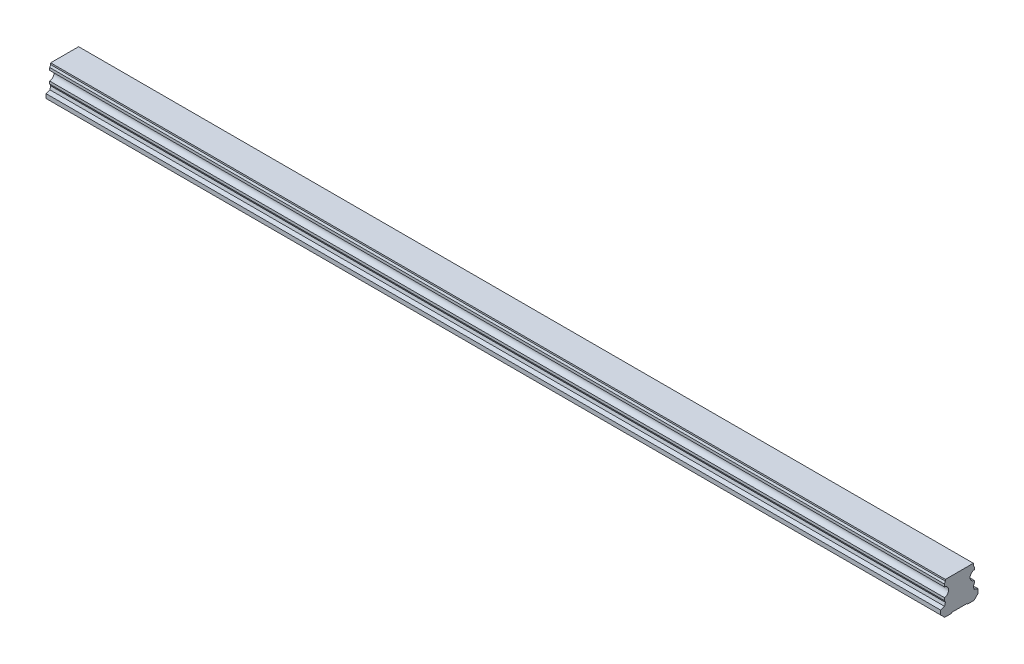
ISO-10303-21;
HEADER;
FILE_DESCRIPTION(('STEP AP214'),'2;1');
FILE_NAME('part.step','',(''),(''),'','','');
FILE_SCHEMA(('AUTOMOTIVE_DESIGN { 1 0 10303 214 1 1 1 1 }'));
ENDSEC;
DATA;
#1=APPLICATION_CONTEXT('core data for automotive mechanical design processes');
#2=APPLICATION_PROTOCOL_DEFINITION('international standard','automotive_design',2000,#1);
#3=PRODUCT_CONTEXT('',#1,'mechanical');
#4=PRODUCT('Part','Part','',(#3));
#5=PRODUCT_RELATED_PRODUCT_CATEGORY('part','',(#4));
#6=PRODUCT_DEFINITION_FORMATION('','',#4);
#7=PRODUCT_DEFINITION_CONTEXT('part definition',#1,'design');
#8=PRODUCT_DEFINITION('design','',#6,#7);
#9=PRODUCT_DEFINITION_SHAPE('','',#8);
#10=(LENGTH_UNIT() NAMED_UNIT(*) SI_UNIT(.MILLI.,.METRE.));
#11=(NAMED_UNIT(*) PLANE_ANGLE_UNIT() SI_UNIT($,.RADIAN.));
#12=(NAMED_UNIT(*) SI_UNIT($,.STERADIAN.) SOLID_ANGLE_UNIT());
#13=UNCERTAINTY_MEASURE_WITH_UNIT(LENGTH_MEASURE(1.E-05),#10,'distance_accuracy_value','');
#14=(GEOMETRIC_REPRESENTATION_CONTEXT(3) GLOBAL_UNCERTAINTY_ASSIGNED_CONTEXT((#13)) GLOBAL_UNIT_ASSIGNED_CONTEXT((#10,
#11,#12)) REPRESENTATION_CONTEXT('',''));
#15=CARTESIAN_POINT('',(0.,0.,0.));
#16=DIRECTION('',(0.,0.,1.));
#17=DIRECTION('',(1.,0.,0.));
#18=AXIS2_PLACEMENT_3D('',#15,#16,#17);
#19=CARTESIAN_POINT('',(570.,0.499999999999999,0.));
#20=DIRECTION('',(0.,-1.,0.));
#21=DIRECTION('',(0.,0.,-1.));
#22=AXIS2_PLACEMENT_3D('',#19,#20,#21);
#23=CONICAL_SURFACE('',#22,3.5,0.785398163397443);
#24=CARTESIAN_POINT('',(570.,1.00000000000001,0.));
#25=DIRECTION('',(0.,1.,0.));
#26=DIRECTION('',(0.,0.,1.));
#27=AXIS2_PLACEMENT_3D('',#24,#25,#26);
#28=CIRCLE('',#27,3.);
#29=CARTESIAN_POINT('',(570.,1.00000000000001,3.));
#30=VERTEX_POINT('',#29);
#31=EDGE_CURVE('E11',#30,#30,#28,.F.);
#32=ORIENTED_EDGE('',*,*,#31,.F.);
#33=EDGE_LOOP('',(#32));
#34=FACE_BOUND('',#33,.T.);
#35=CARTESIAN_POINT('',(570.,0.499999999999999,0.));
#36=DIRECTION('',(0.,1.,0.));
#37=DIRECTION('',(0.,0.,1.));
#38=AXIS2_PLACEMENT_3D('',#35,#36,#37);
#39=CIRCLE('',#38,3.5);
#40=CARTESIAN_POINT('',(570.,0.5,3.5));
#41=VERTEX_POINT('',#40);
#42=EDGE_CURVE('E518',#41,#41,#39,.T.);
#43=ORIENTED_EDGE('',*,*,#42,.F.);
#44=EDGE_LOOP('',(#43));
#45=FACE_BOUND('',#44,.T.);
#46=ADVANCED_FACE('F39',(#34,#45),#23,.F.);
#47=CARTESIAN_POINT('',(570.,12.,0.));
#48=DIRECTION('',(0.,-1.,0.));
#49=DIRECTION('',(0.,0.,-1.));
#50=AXIS2_PLACEMENT_3D('',#47,#48,#49);
#51=CYLINDRICAL_SURFACE('',#50,3.);
#52=ORIENTED_EDGE('',*,*,#31,.T.);
#53=EDGE_LOOP('',(#52));
#54=FACE_BOUND('',#53,.T.);
#55=CARTESIAN_POINT('',(570.,12.,0.));
#56=DIRECTION('',(0.,-1.,0.));
#57=DIRECTION('',(0.,0.,-1.));
#58=AXIS2_PLACEMENT_3D('',#55,#56,#57);
#59=CIRCLE('',#58,3.);
#60=CARTESIAN_POINT('',(570.,12.,-3.));
#61=VERTEX_POINT('',#60);
#62=EDGE_CURVE('E49',#61,#61,#59,.T.);
#63=ORIENTED_EDGE('',*,*,#62,.F.);
#64=EDGE_LOOP('',(#63));
#65=FACE_BOUND('',#64,.T.);
#66=ADVANCED_FACE('F686',(#54,#65),#51,.F.);
#67=CARTESIAN_POINT('',(570.,12.,0.));
#68=DIRECTION('',(0.,-1.,0.));
#69=DIRECTION('',(0.,0.,-1.));
#70=AXIS2_PLACEMENT_3D('',#67,#68,#69);
#71=PLANE('',#70);
#72=CARTESIAN_POINT('',(570.,12.,0.));
#73=DIRECTION('',(0.,-1.,0.));
#74=DIRECTION('',(0.,0.,-1.));
#75=AXIS2_PLACEMENT_3D('',#72,#73,#74);
#76=CIRCLE('',#75,2.5);
#77=CARTESIAN_POINT('',(570.,12.,-2.5));
#78=VERTEX_POINT('',#77);
#79=EDGE_CURVE('E42',#78,#78,#76,.T.);
#80=ORIENTED_EDGE('',*,*,#79,.F.);
#81=EDGE_LOOP('',(#80));
#82=FACE_BOUND('',#81,.T.);
#83=ORIENTED_EDGE('',*,*,#62,.T.);
#84=EDGE_LOOP('',(#83));
#85=FACE_BOUND('',#84,.T.);
#86=ADVANCED_FACE('F691',(#82,#85),#71,.T.);
#87=CARTESIAN_POINT('',(510.,0.499999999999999,0.));
#88=DIRECTION('',(0.,-1.,0.));
#89=DIRECTION('',(0.,0.,-1.));
#90=AXIS2_PLACEMENT_3D('',#87,#88,#89);
#91=CONICAL_SURFACE('',#90,3.5,0.785398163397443);
#92=CARTESIAN_POINT('',(510.,1.00000000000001,0.));
#93=DIRECTION('',(0.,1.,0.));
#94=DIRECTION('',(0.,0.,1.));
#95=AXIS2_PLACEMENT_3D('',#92,#93,#94);
#96=CIRCLE('',#95,3.);
#97=CARTESIAN_POINT('',(510.,1.00000000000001,3.));
#98=VERTEX_POINT('',#97);
#99=EDGE_CURVE('E514',#98,#98,#96,.F.);
#100=ORIENTED_EDGE('',*,*,#99,.F.);
#101=EDGE_LOOP('',(#100));
#102=FACE_BOUND('',#101,.T.);
#103=CARTESIAN_POINT('',(510.,0.499999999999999,0.));
#104=DIRECTION('',(0.,1.,0.));
#105=DIRECTION('',(0.,0.,1.));
#106=AXIS2_PLACEMENT_3D('',#103,#104,#105);
#107=CIRCLE('',#106,3.5);
#108=CARTESIAN_POINT('',(510.,0.5,3.5));
#109=VERTEX_POINT('',#108);
#110=EDGE_CURVE('E506',#109,#109,#107,.T.);
#111=ORIENTED_EDGE('',*,*,#110,.F.);
#112=EDGE_LOOP('',(#111));
#113=FACE_BOUND('',#112,.T.);
#114=ADVANCED_FACE('F848',(#102,#113),#91,.F.);
#115=CARTESIAN_POINT('',(510.,12.,0.));
#116=DIRECTION('',(0.,-1.,0.));
#117=DIRECTION('',(0.,0.,-1.));
#118=AXIS2_PLACEMENT_3D('',#115,#116,#117);
#119=CYLINDRICAL_SURFACE('',#118,3.);
#120=ORIENTED_EDGE('',*,*,#99,.T.);
#121=EDGE_LOOP('',(#120));
#122=FACE_BOUND('',#121,.T.);
#123=CARTESIAN_POINT('',(510.,12.,0.));
#124=DIRECTION('',(0.,-1.,0.));
#125=DIRECTION('',(0.,0.,-1.));
#126=AXIS2_PLACEMENT_3D('',#123,#124,#125);
#127=CIRCLE('',#126,3.);
#128=CARTESIAN_POINT('',(510.,12.,-3.));
#129=VERTEX_POINT('',#128);
#130=EDGE_CURVE('E510',#129,#129,#127,.T.);
#131=ORIENTED_EDGE('',*,*,#130,.F.);
#132=EDGE_LOOP('',(#131));
#133=FACE_BOUND('',#132,.T.);
#134=ADVANCED_FACE('F844',(#122,#133),#119,.F.);
#135=CARTESIAN_POINT('',(510.,12.,0.));
#136=DIRECTION('',(0.,-1.,0.));
#137=DIRECTION('',(0.,0.,-1.));
#138=AXIS2_PLACEMENT_3D('',#135,#136,#137);
#139=PLANE('',#138);
#140=CARTESIAN_POINT('',(510.,12.,0.));
#141=DIRECTION('',(0.,-1.,0.));
#142=DIRECTION('',(0.,0.,-1.));
#143=AXIS2_PLACEMENT_3D('',#140,#141,#142);
#144=CIRCLE('',#143,2.5);
#145=CARTESIAN_POINT('',(510.,12.,-2.5));
#146=VERTEX_POINT('',#145);
#147=EDGE_CURVE('E553',#146,#146,#144,.T.);
#148=ORIENTED_EDGE('',*,*,#147,.F.);
#149=EDGE_LOOP('',(#148));
#150=FACE_BOUND('',#149,.T.);
#151=ORIENTED_EDGE('',*,*,#130,.T.);
#152=EDGE_LOOP('',(#151));
#153=FACE_BOUND('',#152,.T.);
#154=ADVANCED_FACE('F840',(#150,#153),#139,.T.);
#155=CARTESIAN_POINT('',(450.,0.499999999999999,0.));
#156=DIRECTION('',(0.,-1.,0.));
#157=DIRECTION('',(0.,0.,-1.));
#158=AXIS2_PLACEMENT_3D('',#155,#156,#157);
#159=CONICAL_SURFACE('',#158,3.5,0.785398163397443);
#160=CARTESIAN_POINT('',(450.,1.00000000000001,0.));
#161=DIRECTION('',(0.,1.,0.));
#162=DIRECTION('',(0.,0.,1.));
#163=AXIS2_PLACEMENT_3D('',#160,#161,#162);
#164=CIRCLE('',#163,3.);
#165=CARTESIAN_POINT('',(450.,1.00000000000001,3.));
#166=VERTEX_POINT('',#165);
#167=EDGE_CURVE('E502',#166,#166,#164,.F.);
#168=ORIENTED_EDGE('',*,*,#167,.F.);
#169=EDGE_LOOP('',(#168));
#170=FACE_BOUND('',#169,.T.);
#171=CARTESIAN_POINT('',(450.,0.499999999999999,0.));
#172=DIRECTION('',(0.,1.,0.));
#173=DIRECTION('',(0.,0.,1.));
#174=AXIS2_PLACEMENT_3D('',#171,#172,#173);
#175=CIRCLE('',#174,3.5);
#176=CARTESIAN_POINT('',(450.,0.5,3.5));
#177=VERTEX_POINT('',#176);
#178=EDGE_CURVE('E494',#177,#177,#175,.T.);
#179=ORIENTED_EDGE('',*,*,#178,.F.);
#180=EDGE_LOOP('',(#179));
#181=FACE_BOUND('',#180,.T.);
#182=ADVANCED_FACE('F836',(#170,#181),#159,.F.);
#183=CARTESIAN_POINT('',(450.,12.,0.));
#184=DIRECTION('',(0.,-1.,0.));
#185=DIRECTION('',(0.,0.,-1.));
#186=AXIS2_PLACEMENT_3D('',#183,#184,#185);
#187=CYLINDRICAL_SURFACE('',#186,3.);
#188=ORIENTED_EDGE('',*,*,#167,.T.);
#189=EDGE_LOOP('',(#188));
#190=FACE_BOUND('',#189,.T.);
#191=CARTESIAN_POINT('',(450.,12.,0.));
#192=DIRECTION('',(0.,-1.,0.));
#193=DIRECTION('',(0.,0.,-1.));
#194=AXIS2_PLACEMENT_3D('',#191,#192,#193);
#195=CIRCLE('',#194,3.);
#196=CARTESIAN_POINT('',(450.,12.,-3.));
#197=VERTEX_POINT('',#196);
#198=EDGE_CURVE('E498',#197,#197,#195,.T.);
#199=ORIENTED_EDGE('',*,*,#198,.F.);
#200=EDGE_LOOP('',(#199));
#201=FACE_BOUND('',#200,.T.);
#202=ADVANCED_FACE('F832',(#190,#201),#187,.F.);
#203=CARTESIAN_POINT('',(450.,12.,0.));
#204=DIRECTION('',(0.,-1.,0.));
#205=DIRECTION('',(0.,0.,-1.));
#206=AXIS2_PLACEMENT_3D('',#203,#204,#205);
#207=PLANE('',#206);
#208=CARTESIAN_POINT('',(450.,12.,0.));
#209=DIRECTION('',(0.,-1.,0.));
#210=DIRECTION('',(0.,0.,-1.));
#211=AXIS2_PLACEMENT_3D('',#208,#209,#210);
#212=CIRCLE('',#211,2.5);
#213=CARTESIAN_POINT('',(450.,12.,-2.5));
#214=VERTEX_POINT('',#213);
#215=EDGE_CURVE('E550',#214,#214,#212,.T.);
#216=ORIENTED_EDGE('',*,*,#215,.F.);
#217=EDGE_LOOP('',(#216));
#218=FACE_BOUND('',#217,.T.);
#219=ORIENTED_EDGE('',*,*,#198,.T.);
#220=EDGE_LOOP('',(#219));
#221=FACE_BOUND('',#220,.T.);
#222=ADVANCED_FACE('F828',(#218,#221),#207,.T.);
#223=CARTESIAN_POINT('',(390.,0.499999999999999,0.));
#224=DIRECTION('',(0.,-1.,0.));
#225=DIRECTION('',(0.,0.,-1.));
#226=AXIS2_PLACEMENT_3D('',#223,#224,#225);
#227=CONICAL_SURFACE('',#226,3.5,0.785398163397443);
#228=CARTESIAN_POINT('',(390.,1.00000000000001,0.));
#229=DIRECTION('',(0.,1.,0.));
#230=DIRECTION('',(0.,0.,1.));
#231=AXIS2_PLACEMENT_3D('',#228,#229,#230);
#232=CIRCLE('',#231,3.);
#233=CARTESIAN_POINT('',(390.,1.00000000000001,3.));
#234=VERTEX_POINT('',#233);
#235=EDGE_CURVE('E490',#234,#234,#232,.F.);
#236=ORIENTED_EDGE('',*,*,#235,.F.);
#237=EDGE_LOOP('',(#236));
#238=FACE_BOUND('',#237,.T.);
#239=CARTESIAN_POINT('',(390.,0.499999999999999,0.));
#240=DIRECTION('',(0.,1.,0.));
#241=DIRECTION('',(0.,0.,1.));
#242=AXIS2_PLACEMENT_3D('',#239,#240,#241);
#243=CIRCLE('',#242,3.5);
#244=CARTESIAN_POINT('',(390.,0.5,3.5));
#245=VERTEX_POINT('',#244);
#246=EDGE_CURVE('E482',#245,#245,#243,.T.);
#247=ORIENTED_EDGE('',*,*,#246,.F.);
#248=EDGE_LOOP('',(#247));
#249=FACE_BOUND('',#248,.T.);
#250=ADVANCED_FACE('F824',(#238,#249),#227,.F.);
#251=CARTESIAN_POINT('',(390.,12.,0.));
#252=DIRECTION('',(0.,-1.,0.));
#253=DIRECTION('',(0.,0.,-1.));
#254=AXIS2_PLACEMENT_3D('',#251,#252,#253);
#255=CYLINDRICAL_SURFACE('',#254,3.);
#256=ORIENTED_EDGE('',*,*,#235,.T.);
#257=EDGE_LOOP('',(#256));
#258=FACE_BOUND('',#257,.T.);
#259=CARTESIAN_POINT('',(390.,12.,0.));
#260=DIRECTION('',(0.,-1.,0.));
#261=DIRECTION('',(0.,0.,-1.));
#262=AXIS2_PLACEMENT_3D('',#259,#260,#261);
#263=CIRCLE('',#262,3.);
#264=CARTESIAN_POINT('',(390.,12.,-3.));
#265=VERTEX_POINT('',#264);
#266=EDGE_CURVE('E486',#265,#265,#263,.T.);
#267=ORIENTED_EDGE('',*,*,#266,.F.);
#268=EDGE_LOOP('',(#267));
#269=FACE_BOUND('',#268,.T.);
#270=ADVANCED_FACE('F820',(#258,#269),#255,.F.);
#271=CARTESIAN_POINT('',(390.,12.,0.));
#272=DIRECTION('',(0.,-1.,0.));
#273=DIRECTION('',(0.,0.,-1.));
#274=AXIS2_PLACEMENT_3D('',#271,#272,#273);
#275=PLANE('',#274);
#276=CARTESIAN_POINT('',(390.,12.,0.));
#277=DIRECTION('',(0.,-1.,0.));
#278=DIRECTION('',(0.,0.,-1.));
#279=AXIS2_PLACEMENT_3D('',#276,#277,#278);
#280=CIRCLE('',#279,2.5);
#281=CARTESIAN_POINT('',(390.,12.,-2.5));
#282=VERTEX_POINT('',#281);
#283=EDGE_CURVE('E546',#282,#282,#280,.T.);
#284=ORIENTED_EDGE('',*,*,#283,.F.);
#285=EDGE_LOOP('',(#284));
#286=FACE_BOUND('',#285,.T.);
#287=ORIENTED_EDGE('',*,*,#266,.T.);
#288=EDGE_LOOP('',(#287));
#289=FACE_BOUND('',#288,.T.);
#290=ADVANCED_FACE('F816',(#286,#289),#275,.T.);
#291=CARTESIAN_POINT('',(330.,0.499999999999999,0.));
#292=DIRECTION('',(0.,-1.,0.));
#293=DIRECTION('',(0.,0.,-1.));
#294=AXIS2_PLACEMENT_3D('',#291,#292,#293);
#295=CONICAL_SURFACE('',#294,3.5,0.785398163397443);
#296=CARTESIAN_POINT('',(330.,1.00000000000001,0.));
#297=DIRECTION('',(0.,1.,0.));
#298=DIRECTION('',(0.,0.,1.));
#299=AXIS2_PLACEMENT_3D('',#296,#297,#298);
#300=CIRCLE('',#299,3.);
#301=CARTESIAN_POINT('',(330.,1.00000000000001,3.));
#302=VERTEX_POINT('',#301);
#303=EDGE_CURVE('E478',#302,#302,#300,.F.);
#304=ORIENTED_EDGE('',*,*,#303,.F.);
#305=EDGE_LOOP('',(#304));
#306=FACE_BOUND('',#305,.T.);
#307=CARTESIAN_POINT('',(330.,0.499999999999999,0.));
#308=DIRECTION('',(0.,1.,0.));
#309=DIRECTION('',(0.,0.,1.));
#310=AXIS2_PLACEMENT_3D('',#307,#308,#309);
#311=CIRCLE('',#310,3.5);
#312=CARTESIAN_POINT('',(330.,0.5,3.5));
#313=VERTEX_POINT('',#312);
#314=EDGE_CURVE('E470',#313,#313,#311,.T.);
#315=ORIENTED_EDGE('',*,*,#314,.F.);
#316=EDGE_LOOP('',(#315));
#317=FACE_BOUND('',#316,.T.);
#318=ADVANCED_FACE('F812',(#306,#317),#295,.F.);
#319=CARTESIAN_POINT('',(330.,12.,0.));
#320=DIRECTION('',(0.,-1.,0.));
#321=DIRECTION('',(0.,0.,-1.));
#322=AXIS2_PLACEMENT_3D('',#319,#320,#321);
#323=CYLINDRICAL_SURFACE('',#322,3.);
#324=ORIENTED_EDGE('',*,*,#303,.T.);
#325=EDGE_LOOP('',(#324));
#326=FACE_BOUND('',#325,.T.);
#327=CARTESIAN_POINT('',(330.,12.,0.));
#328=DIRECTION('',(0.,-1.,0.));
#329=DIRECTION('',(0.,0.,-1.));
#330=AXIS2_PLACEMENT_3D('',#327,#328,#329);
#331=CIRCLE('',#330,3.);
#332=CARTESIAN_POINT('',(330.,12.,-3.));
#333=VERTEX_POINT('',#332);
#334=EDGE_CURVE('E474',#333,#333,#331,.T.);
#335=ORIENTED_EDGE('',*,*,#334,.F.);
#336=EDGE_LOOP('',(#335));
#337=FACE_BOUND('',#336,.T.);
#338=ADVANCED_FACE('F808',(#326,#337),#323,.F.);
#339=CARTESIAN_POINT('',(330.,12.,0.));
#340=DIRECTION('',(0.,-1.,0.));
#341=DIRECTION('',(0.,0.,-1.));
#342=AXIS2_PLACEMENT_3D('',#339,#340,#341);
#343=PLANE('',#342);
#344=CARTESIAN_POINT('',(330.,12.,0.));
#345=DIRECTION('',(0.,-1.,0.));
#346=DIRECTION('',(0.,0.,-1.));
#347=AXIS2_PLACEMENT_3D('',#344,#345,#346);
#348=CIRCLE('',#347,2.5);
#349=CARTESIAN_POINT('',(330.,12.,-2.5));
#350=VERTEX_POINT('',#349);
#351=EDGE_CURVE('E542',#350,#350,#348,.T.);
#352=ORIENTED_EDGE('',*,*,#351,.F.);
#353=EDGE_LOOP('',(#352));
#354=FACE_BOUND('',#353,.T.);
#355=ORIENTED_EDGE('',*,*,#334,.T.);
#356=EDGE_LOOP('',(#355));
#357=FACE_BOUND('',#356,.T.);
#358=ADVANCED_FACE('F804',(#354,#357),#343,.T.);
#359=CARTESIAN_POINT('',(270.,0.499999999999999,0.));
#360=DIRECTION('',(0.,-1.,0.));
#361=DIRECTION('',(0.,0.,-1.));
#362=AXIS2_PLACEMENT_3D('',#359,#360,#361);
#363=CONICAL_SURFACE('',#362,3.5,0.785398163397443);
#364=CARTESIAN_POINT('',(270.,1.00000000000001,0.));
#365=DIRECTION('',(0.,1.,0.));
#366=DIRECTION('',(0.,0.,1.));
#367=AXIS2_PLACEMENT_3D('',#364,#365,#366);
#368=CIRCLE('',#367,3.);
#369=CARTESIAN_POINT('',(270.,1.00000000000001,3.));
#370=VERTEX_POINT('',#369);
#371=EDGE_CURVE('E466',#370,#370,#368,.F.);
#372=ORIENTED_EDGE('',*,*,#371,.F.);
#373=EDGE_LOOP('',(#372));
#374=FACE_BOUND('',#373,.T.);
#375=CARTESIAN_POINT('',(270.,0.499999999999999,0.));
#376=DIRECTION('',(0.,1.,0.));
#377=DIRECTION('',(0.,0.,1.));
#378=AXIS2_PLACEMENT_3D('',#375,#376,#377);
#379=CIRCLE('',#378,3.5);
#380=CARTESIAN_POINT('',(270.,0.5,3.5));
#381=VERTEX_POINT('',#380);
#382=EDGE_CURVE('E458',#381,#381,#379,.T.);
#383=ORIENTED_EDGE('',*,*,#382,.F.);
#384=EDGE_LOOP('',(#383));
#385=FACE_BOUND('',#384,.T.);
#386=ADVANCED_FACE('F800',(#374,#385),#363,.F.);
#387=CARTESIAN_POINT('',(270.,12.,0.));
#388=DIRECTION('',(0.,-1.,0.));
#389=DIRECTION('',(0.,0.,-1.));
#390=AXIS2_PLACEMENT_3D('',#387,#388,#389);
#391=CYLINDRICAL_SURFACE('',#390,3.);
#392=ORIENTED_EDGE('',*,*,#371,.T.);
#393=EDGE_LOOP('',(#392));
#394=FACE_BOUND('',#393,.T.);
#395=CARTESIAN_POINT('',(270.,12.,0.));
#396=DIRECTION('',(0.,-1.,0.));
#397=DIRECTION('',(0.,0.,-1.));
#398=AXIS2_PLACEMENT_3D('',#395,#396,#397);
#399=CIRCLE('',#398,3.);
#400=CARTESIAN_POINT('',(270.,12.,-3.));
#401=VERTEX_POINT('',#400);
#402=EDGE_CURVE('E462',#401,#401,#399,.T.);
#403=ORIENTED_EDGE('',*,*,#402,.F.);
#404=EDGE_LOOP('',(#403));
#405=FACE_BOUND('',#404,.T.);
#406=ADVANCED_FACE('F796',(#394,#405),#391,.F.);
#407=CARTESIAN_POINT('',(270.,12.,0.));
#408=DIRECTION('',(0.,-1.,0.));
#409=DIRECTION('',(0.,0.,-1.));
#410=AXIS2_PLACEMENT_3D('',#407,#408,#409);
#411=PLANE('',#410);
#412=CARTESIAN_POINT('',(270.,12.,0.));
#413=DIRECTION('',(0.,-1.,0.));
#414=DIRECTION('',(0.,0.,-1.));
#415=AXIS2_PLACEMENT_3D('',#412,#413,#414);
#416=CIRCLE('',#415,2.5);
#417=CARTESIAN_POINT('',(270.,12.,-2.5));
#418=VERTEX_POINT('',#417);
#419=EDGE_CURVE('E538',#418,#418,#416,.T.);
#420=ORIENTED_EDGE('',*,*,#419,.F.);
#421=EDGE_LOOP('',(#420));
#422=FACE_BOUND('',#421,.T.);
#423=ORIENTED_EDGE('',*,*,#402,.T.);
#424=EDGE_LOOP('',(#423));
#425=FACE_BOUND('',#424,.T.);
#426=ADVANCED_FACE('F792',(#422,#425),#411,.T.);
#427=CARTESIAN_POINT('',(210.,0.499999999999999,0.));
#428=DIRECTION('',(0.,-1.,0.));
#429=DIRECTION('',(0.,0.,-1.));
#430=AXIS2_PLACEMENT_3D('',#427,#428,#429);
#431=CONICAL_SURFACE('',#430,3.5,0.785398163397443);
#432=CARTESIAN_POINT('',(210.,1.00000000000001,0.));
#433=DIRECTION('',(0.,1.,0.));
#434=DIRECTION('',(0.,0.,1.));
#435=AXIS2_PLACEMENT_3D('',#432,#433,#434);
#436=CIRCLE('',#435,3.);
#437=CARTESIAN_POINT('',(210.,1.00000000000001,3.));
#438=VERTEX_POINT('',#437);
#439=EDGE_CURVE('E454',#438,#438,#436,.F.);
#440=ORIENTED_EDGE('',*,*,#439,.F.);
#441=EDGE_LOOP('',(#440));
#442=FACE_BOUND('',#441,.T.);
#443=CARTESIAN_POINT('',(210.,0.499999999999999,0.));
#444=DIRECTION('',(0.,1.,0.));
#445=DIRECTION('',(0.,0.,1.));
#446=AXIS2_PLACEMENT_3D('',#443,#444,#445);
#447=CIRCLE('',#446,3.5);
#448=CARTESIAN_POINT('',(210.,0.5,3.5));
#449=VERTEX_POINT('',#448);
#450=EDGE_CURVE('E446',#449,#449,#447,.T.);
#451=ORIENTED_EDGE('',*,*,#450,.F.);
#452=EDGE_LOOP('',(#451));
#453=FACE_BOUND('',#452,.T.);
#454=ADVANCED_FACE('F788',(#442,#453),#431,.F.);
#455=CARTESIAN_POINT('',(210.,12.,0.));
#456=DIRECTION('',(0.,-1.,0.));
#457=DIRECTION('',(0.,0.,-1.));
#458=AXIS2_PLACEMENT_3D('',#455,#456,#457);
#459=CYLINDRICAL_SURFACE('',#458,3.);
#460=ORIENTED_EDGE('',*,*,#439,.T.);
#461=EDGE_LOOP('',(#460));
#462=FACE_BOUND('',#461,.T.);
#463=CARTESIAN_POINT('',(210.,12.,0.));
#464=DIRECTION('',(0.,-1.,0.));
#465=DIRECTION('',(0.,0.,-1.));
#466=AXIS2_PLACEMENT_3D('',#463,#464,#465);
#467=CIRCLE('',#466,3.);
#468=CARTESIAN_POINT('',(210.,12.,-3.));
#469=VERTEX_POINT('',#468);
#470=EDGE_CURVE('E450',#469,#469,#467,.T.);
#471=ORIENTED_EDGE('',*,*,#470,.F.);
#472=EDGE_LOOP('',(#471));
#473=FACE_BOUND('',#472,.T.);
#474=ADVANCED_FACE('F784',(#462,#473),#459,.F.);
#475=CARTESIAN_POINT('',(210.,12.,0.));
#476=DIRECTION('',(0.,-1.,0.));
#477=DIRECTION('',(0.,0.,-1.));
#478=AXIS2_PLACEMENT_3D('',#475,#476,#477);
#479=PLANE('',#478);
#480=CARTESIAN_POINT('',(210.,12.,0.));
#481=DIRECTION('',(0.,-1.,0.));
#482=DIRECTION('',(0.,0.,-1.));
#483=AXIS2_PLACEMENT_3D('',#480,#481,#482);
#484=CIRCLE('',#483,2.5);
#485=CARTESIAN_POINT('',(210.,12.,-2.5));
#486=VERTEX_POINT('',#485);
#487=EDGE_CURVE('E534',#486,#486,#484,.T.);
#488=ORIENTED_EDGE('',*,*,#487,.F.);
#489=EDGE_LOOP('',(#488));
#490=FACE_BOUND('',#489,.T.);
#491=ORIENTED_EDGE('',*,*,#470,.T.);
#492=EDGE_LOOP('',(#491));
#493=FACE_BOUND('',#492,.T.);
#494=ADVANCED_FACE('F780',(#490,#493),#479,.T.);
#495=CARTESIAN_POINT('',(150.,0.499999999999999,0.));
#496=DIRECTION('',(0.,-1.,0.));
#497=DIRECTION('',(0.,0.,-1.));
#498=AXIS2_PLACEMENT_3D('',#495,#496,#497);
#499=CONICAL_SURFACE('',#498,3.5,0.785398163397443);
#500=CARTESIAN_POINT('',(150.,1.00000000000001,0.));
#501=DIRECTION('',(0.,1.,0.));
#502=DIRECTION('',(0.,0.,1.));
#503=AXIS2_PLACEMENT_3D('',#500,#501,#502);
#504=CIRCLE('',#503,3.);
#505=CARTESIAN_POINT('',(150.,1.00000000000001,3.));
#506=VERTEX_POINT('',#505);
#507=EDGE_CURVE('E442',#506,#506,#504,.F.);
#508=ORIENTED_EDGE('',*,*,#507,.F.);
#509=EDGE_LOOP('',(#508));
#510=FACE_BOUND('',#509,.T.);
#511=CARTESIAN_POINT('',(150.,0.499999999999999,0.));
#512=DIRECTION('',(0.,1.,0.));
#513=DIRECTION('',(0.,0.,1.));
#514=AXIS2_PLACEMENT_3D('',#511,#512,#513);
#515=CIRCLE('',#514,3.5);
#516=CARTESIAN_POINT('',(150.,0.5,3.5));
#517=VERTEX_POINT('',#516);
#518=EDGE_CURVE('E434',#517,#517,#515,.T.);
#519=ORIENTED_EDGE('',*,*,#518,.F.);
#520=EDGE_LOOP('',(#519));
#521=FACE_BOUND('',#520,.T.);
#522=ADVANCED_FACE('F776',(#510,#521),#499,.F.);
#523=CARTESIAN_POINT('',(150.,12.,0.));
#524=DIRECTION('',(0.,-1.,0.));
#525=DIRECTION('',(0.,0.,-1.));
#526=AXIS2_PLACEMENT_3D('',#523,#524,#525);
#527=CYLINDRICAL_SURFACE('',#526,3.);
#528=ORIENTED_EDGE('',*,*,#507,.T.);
#529=EDGE_LOOP('',(#528));
#530=FACE_BOUND('',#529,.T.);
#531=CARTESIAN_POINT('',(150.,12.,0.));
#532=DIRECTION('',(0.,-1.,0.));
#533=DIRECTION('',(0.,0.,-1.));
#534=AXIS2_PLACEMENT_3D('',#531,#532,#533);
#535=CIRCLE('',#534,3.);
#536=CARTESIAN_POINT('',(150.,12.,-3.));
#537=VERTEX_POINT('',#536);
#538=EDGE_CURVE('E438',#537,#537,#535,.T.);
#539=ORIENTED_EDGE('',*,*,#538,.F.);
#540=EDGE_LOOP('',(#539));
#541=FACE_BOUND('',#540,.T.);
#542=ADVANCED_FACE('F772',(#530,#541),#527,.F.);
#543=CARTESIAN_POINT('',(150.,12.,0.));
#544=DIRECTION('',(0.,-1.,0.));
#545=DIRECTION('',(0.,0.,-1.));
#546=AXIS2_PLACEMENT_3D('',#543,#544,#545);
#547=PLANE('',#546);
#548=CARTESIAN_POINT('',(150.,12.,0.));
#549=DIRECTION('',(0.,-1.,0.));
#550=DIRECTION('',(0.,0.,-1.));
#551=AXIS2_PLACEMENT_3D('',#548,#549,#550);
#552=CIRCLE('',#551,2.5);
#553=CARTESIAN_POINT('',(150.,12.,-2.5));
#554=VERTEX_POINT('',#553);
#555=EDGE_CURVE('E529',#554,#554,#552,.T.);
#556=ORIENTED_EDGE('',*,*,#555,.F.);
#557=EDGE_LOOP('',(#556));
#558=FACE_BOUND('',#557,.T.);
#559=ORIENTED_EDGE('',*,*,#538,.T.);
#560=EDGE_LOOP('',(#559));
#561=FACE_BOUND('',#560,.T.);
#562=ADVANCED_FACE('F763',(#558,#561),#547,.T.);
#563=CARTESIAN_POINT('',(600.,21.8,-9.375));
#564=DIRECTION('',(0.,0.,1.));
#565=DIRECTION('',(0.,-1.,0.));
#566=AXIS2_PLACEMENT_3D('',#563,#564,#565);
#567=PLANE('',#566);
#568=DIRECTION('',(0.,1.,0.));
#569=VECTOR('',#568,1.);
#570=CARTESIAN_POINT('',(0.,21.8,-9.375));
#571=LINE('',#570,#569);
#572=CARTESIAN_POINT('',(0.,20.756,-9.375));
#573=VERTEX_POINT('',#572);
#574=CARTESIAN_POINT('',(0.,21.8,-9.375));
#575=VERTEX_POINT('',#574);
#576=EDGE_CURVE('E256',#573,#575,#571,.T.);
#577=ORIENTED_EDGE('',*,*,#576,.T.);
#578=DIRECTION('',(-1.,0.,0.));
#579=VECTOR('',#578,1.);
#580=CARTESIAN_POINT('',(600.,21.8,-9.375));
#581=LINE('',#580,#579);
#582=CARTESIAN_POINT('',(600.,21.8,-9.375));
#583=VERTEX_POINT('',#582);
#584=EDGE_CURVE('E423',#583,#575,#581,.T.);
#585=ORIENTED_EDGE('',*,*,#584,.F.);
#586=DIRECTION('',(0.,1.,0.));
#587=VECTOR('',#586,1.);
#588=CARTESIAN_POINT('',(600.,21.8,-9.375));
#589=LINE('',#588,#587);
#590=CARTESIAN_POINT('',(600.,20.756,-9.375));
#591=VERTEX_POINT('',#590);
#592=EDGE_CURVE('E332',#591,#583,#589,.T.);
#593=ORIENTED_EDGE('',*,*,#592,.F.);
#594=DIRECTION('',(-1.,0.,0.));
#595=VECTOR('',#594,1.);
#596=CARTESIAN_POINT('',(600.,20.756,-9.375));
#597=LINE('',#596,#595);
#598=EDGE_CURVE('E252',#591,#573,#597,.T.);
#599=ORIENTED_EDGE('',*,*,#598,.T.);
#600=EDGE_LOOP('',(#577,#585,#593,#599));
#601=FACE_BOUND('',#600,.T.);
#602=ADVANCED_FACE('F673',(#601),#567,.F.);
#603=CARTESIAN_POINT('',(600.,21.8,-9.375));
#604=DIRECTION('',(0.,-1.,0.));
#605=DIRECTION('',(0.,0.,-1.));
#606=AXIS2_PLACEMENT_3D('',#603,#604,#605);
#607=PLANE('',#606);
#608=DIRECTION('',(0.,0.,1.));
#609=VECTOR('',#608,1.);
#610=CARTESIAN_POINT('',(0.,21.8,-9.375));
#611=LINE('',#610,#609);
#612=CARTESIAN_POINT('',(0.,21.8,9.375));
#613=VERTEX_POINT('',#612);
#614=EDGE_CURVE('E260',#575,#613,#611,.T.);
#615=ORIENTED_EDGE('',*,*,#614,.T.);
#616=DIRECTION('',(-1.,0.,0.));
#617=VECTOR('',#616,1.);
#618=CARTESIAN_POINT('',(600.,21.8,9.375));
#619=LINE('',#618,#617);
#620=CARTESIAN_POINT('',(600.,21.8,9.375));
#621=VERTEX_POINT('',#620);
#622=EDGE_CURVE('E419',#621,#613,#619,.T.);
#623=ORIENTED_EDGE('',*,*,#622,.F.);
#624=DIRECTION('',(0.,0.,1.));
#625=VECTOR('',#624,1.);
#626=CARTESIAN_POINT('',(600.,21.8,-9.375));
#627=LINE('',#626,#625);
#628=EDGE_CURVE('E157',#583,#621,#627,.T.);
#629=ORIENTED_EDGE('',*,*,#628,.F.);
#630=ORIENTED_EDGE('',*,*,#584,.T.);
#631=EDGE_LOOP('',(#615,#623,#629,#630));
#632=FACE_BOUND('',#631,.T.);
#633=ADVANCED_FACE('F757',(#632),#607,.F.);
#634=CARTESIAN_POINT('',(600.,21.8,9.375));
#635=DIRECTION('',(0.,0.,-1.));
#636=DIRECTION('',(0.,1.,0.));
#637=AXIS2_PLACEMENT_3D('',#634,#635,#636);
#638=PLANE('',#637);
#639=DIRECTION('',(0.,-1.,0.));
#640=VECTOR('',#639,1.);
#641=CARTESIAN_POINT('',(0.,21.8,9.375));
#642=LINE('',#641,#640);
#643=CARTESIAN_POINT('',(0.,20.756,9.37499999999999));
#644=VERTEX_POINT('',#643);
#645=EDGE_CURVE('E264',#613,#644,#642,.T.);
#646=ORIENTED_EDGE('',*,*,#645,.T.);
#647=DIRECTION('',(-1.,0.,0.));
#648=VECTOR('',#647,1.);
#649=CARTESIAN_POINT('',(600.,20.756,9.37499999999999));
#650=LINE('',#649,#648);
#651=CARTESIAN_POINT('',(600.,20.756,9.37499999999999));
#652=VERTEX_POINT('',#651);
#653=EDGE_CURVE('E415',#652,#644,#650,.T.);
#654=ORIENTED_EDGE('',*,*,#653,.F.);
#655=DIRECTION('',(0.,-1.,0.));
#656=VECTOR('',#655,1.);
#657=CARTESIAN_POINT('',(600.,21.8,9.375));
#658=LINE('',#657,#656);
#659=EDGE_CURVE('E596',#621,#652,#658,.T.);
#660=ORIENTED_EDGE('',*,*,#659,.F.);
#661=ORIENTED_EDGE('',*,*,#622,.T.);
#662=EDGE_LOOP('',(#646,#654,#660,#661));
#663=FACE_BOUND('',#662,.T.);
#664=ADVANCED_FACE('F753',(#663),#638,.F.);
#665=CARTESIAN_POINT('',(600.,20.756,9.37499999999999));
#666=DIRECTION('',(0.,-0.422618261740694,-0.906307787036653));
#667=DIRECTION('',(0.,0.906307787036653,-0.422618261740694));
#668=AXIS2_PLACEMENT_3D('',#665,#666,#667);
#669=PLANE('',#668);
#670=DIRECTION('',(0.,-0.906307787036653,0.422618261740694));
#671=VECTOR('',#670,1.);
#672=CARTESIAN_POINT('',(0.,20.756,9.37499999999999));
#673=LINE('',#672,#671);
#674=CARTESIAN_POINT('',(0.,19.4156831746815,10.));
#675=VERTEX_POINT('',#674);
#676=EDGE_CURVE('E267',#644,#675,#673,.T.);
#677=ORIENTED_EDGE('',*,*,#676,.T.);
#678=DIRECTION('',(-1.,0.,0.));
#679=VECTOR('',#678,1.);
#680=CARTESIAN_POINT('',(600.,19.4156831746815,10.));
#681=LINE('',#680,#679);
#682=CARTESIAN_POINT('',(600.,19.4156831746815,10.));
#683=VERTEX_POINT('',#682);
#684=EDGE_CURVE('E411',#683,#675,#681,.T.);
#685=ORIENTED_EDGE('',*,*,#684,.F.);
#686=DIRECTION('',(0.,-0.906307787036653,0.422618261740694));
#687=VECTOR('',#686,1.);
#688=CARTESIAN_POINT('',(600.,20.756,9.37499999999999));
#689=LINE('',#688,#687);
#690=EDGE_CURVE('E599',#652,#683,#689,.T.);
#691=ORIENTED_EDGE('',*,*,#690,.F.);
#692=ORIENTED_EDGE('',*,*,#653,.T.);
#693=EDGE_LOOP('',(#677,#685,#691,#692));
#694=FACE_BOUND('',#693,.T.);
#695=ADVANCED_FACE('F749',(#694),#669,.F.);
#696=CARTESIAN_POINT('',(600.,19.4156831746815,10.));
#697=DIRECTION('',(0.,0.,-1.));
#698=DIRECTION('',(-1.,0.,0.));
#699=AXIS2_PLACEMENT_3D('',#696,#697,#698);
#700=PLANE('',#699);
#701=DIRECTION('',(0.,-1.,0.));
#702=VECTOR('',#701,1.);
#703=CARTESIAN_POINT('',(0.,19.4156831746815,10.));
#704=LINE('',#703,#702);
#705=CARTESIAN_POINT('',(0.,17.6854497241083,10.));
#706=VERTEX_POINT('',#705);
#707=EDGE_CURVE('E270',#675,#706,#704,.T.);
#708=ORIENTED_EDGE('',*,*,#707,.T.);
#709=DIRECTION('',(-1.,0.,0.));
#710=VECTOR('',#709,1.);
#711=CARTESIAN_POINT('',(600.,17.6854497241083,10.));
#712=LINE('',#711,#710);
#713=CARTESIAN_POINT('',(600.,17.6854497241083,10.));
#714=VERTEX_POINT('',#713);
#715=EDGE_CURVE('E407',#714,#706,#712,.T.);
#716=ORIENTED_EDGE('',*,*,#715,.F.);
#717=DIRECTION('',(0.,-1.,0.));
#718=VECTOR('',#717,1.);
#719=CARTESIAN_POINT('',(600.,19.4156831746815,10.));
#720=LINE('',#719,#718);
#721=EDGE_CURVE('E602',#683,#714,#720,.T.);
#722=ORIENTED_EDGE('',*,*,#721,.F.);
#723=ORIENTED_EDGE('',*,*,#684,.T.);
#724=EDGE_LOOP('',(#708,#716,#722,#723));
#725=FACE_BOUND('',#724,.T.);
#726=ADVANCED_FACE('F745',(#725),#700,.F.);
#727=CARTESIAN_POINT('',(600.,14.6,10.3));
#728=DIRECTION('',(-1.,0.,0.));
#729=DIRECTION('',(0.,0.,1.));
#730=AXIS2_PLACEMENT_3D('',#727,#728,#729);
#731=CYLINDRICAL_SURFACE('',#730,3.1);
#732=CARTESIAN_POINT('',(0.,14.6,10.3));
#733=DIRECTION('',(-1.,0.,0.));
#734=DIRECTION('',(0.,0.,-1.));
#735=AXIS2_PLACEMENT_3D('',#732,#733,#734);
#736=CIRCLE('',#735,3.1);
#737=CARTESIAN_POINT('',(0.,11.5145502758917,10.));
#738=VERTEX_POINT('',#737);
#739=EDGE_CURVE('E273',#706,#738,#736,.T.);
#740=ORIENTED_EDGE('',*,*,#739,.T.);
#741=DIRECTION('',(-1.,0.,0.));
#742=VECTOR('',#741,1.);
#743=CARTESIAN_POINT('',(600.,11.5145502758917,10.));
#744=LINE('',#743,#742);
#745=CARTESIAN_POINT('',(600.,11.5145502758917,10.));
#746=VERTEX_POINT('',#745);
#747=EDGE_CURVE('E403',#746,#738,#744,.T.);
#748=ORIENTED_EDGE('',*,*,#747,.F.);
#749=CARTESIAN_POINT('',(600.,14.6,10.3));
#750=DIRECTION('',(-1.,0.,0.));
#751=DIRECTION('',(0.,0.,-1.));
#752=AXIS2_PLACEMENT_3D('',#749,#750,#751);
#753=CIRCLE('',#752,3.1);
#754=EDGE_CURVE('E605',#714,#746,#753,.T.);
#755=ORIENTED_EDGE('',*,*,#754,.F.);
#756=ORIENTED_EDGE('',*,*,#715,.T.);
#757=EDGE_LOOP('',(#740,#748,#755,#756));
#758=FACE_BOUND('',#757,.T.);
#759=ADVANCED_FACE('F741',(#758),#731,.F.);
#760=CARTESIAN_POINT('',(600.,9.78431682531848,10.));
#761=DIRECTION('',(0.,0.,-1.));
#762=DIRECTION('',(0.,1.,0.));
#763=AXIS2_PLACEMENT_3D('',#760,#761,#762);
#764=PLANE('',#763);
#765=DIRECTION('',(0.,-1.,0.));
#766=VECTOR('',#765,1.);
#767=CARTESIAN_POINT('',(0.,9.78431682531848,10.));
#768=LINE('',#767,#766);
#769=CARTESIAN_POINT('',(0.,9.78431682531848,10.));
#770=VERTEX_POINT('',#769);
#771=EDGE_CURVE('E276',#738,#770,#768,.T.);
#772=ORIENTED_EDGE('',*,*,#771,.T.);
#773=DIRECTION('',(-1.,0.,0.));
#774=VECTOR('',#773,1.);
#775=CARTESIAN_POINT('',(600.,9.78431682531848,10.));
#776=LINE('',#775,#774);
#777=CARTESIAN_POINT('',(600.,9.78431682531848,10.));
#778=VERTEX_POINT('',#777);
#779=EDGE_CURVE('E399',#778,#770,#776,.T.);
#780=ORIENTED_EDGE('',*,*,#779,.F.);
#781=DIRECTION('',(0.,-1.,0.));
#782=VECTOR('',#781,1.);
#783=CARTESIAN_POINT('',(600.,9.78431682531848,10.));
#784=LINE('',#783,#782);
#785=EDGE_CURVE('E608',#746,#778,#784,.T.);
#786=ORIENTED_EDGE('',*,*,#785,.F.);
#787=ORIENTED_EDGE('',*,*,#747,.T.);
#788=EDGE_LOOP('',(#772,#780,#786,#787));
#789=FACE_BOUND('',#788,.T.);
#790=ADVANCED_FACE('F737',(#789),#764,.F.);
#791=CARTESIAN_POINT('',(600.,8.44400000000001,9.375));
#792=DIRECTION('',(0.,0.4226182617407,-0.90630778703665));
#793=DIRECTION('',(0.,0.90630778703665,0.4226182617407));
#794=AXIS2_PLACEMENT_3D('',#791,#792,#793);
#795=PLANE('',#794);
#796=DIRECTION('',(0.,-0.90630778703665,-0.4226182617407));
#797=VECTOR('',#796,1.);
#798=CARTESIAN_POINT('',(0.,8.44400000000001,9.375));
#799=LINE('',#798,#797);
#800=CARTESIAN_POINT('',(0.,8.44400000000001,9.375));
#801=VERTEX_POINT('',#800);
#802=EDGE_CURVE('E279',#770,#801,#799,.T.);
#803=ORIENTED_EDGE('',*,*,#802,.T.);
#804=DIRECTION('',(-1.,0.,0.));
#805=VECTOR('',#804,1.);
#806=CARTESIAN_POINT('',(600.,8.44400000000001,9.375));
#807=LINE('',#806,#805);
#808=CARTESIAN_POINT('',(600.,8.44400000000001,9.375));
#809=VERTEX_POINT('',#808);
#810=EDGE_CURVE('E395',#809,#801,#807,.T.);
#811=ORIENTED_EDGE('',*,*,#810,.F.);
#812=DIRECTION('',(0.,-0.90630778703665,-0.4226182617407));
#813=VECTOR('',#812,1.);
#814=CARTESIAN_POINT('',(600.,8.44400000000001,9.375));
#815=LINE('',#814,#813);
#816=EDGE_CURVE('E611',#778,#809,#815,.T.);
#817=ORIENTED_EDGE('',*,*,#816,.F.);
#818=ORIENTED_EDGE('',*,*,#779,.T.);
#819=EDGE_LOOP('',(#803,#811,#817,#818));
#820=FACE_BOUND('',#819,.T.);
#821=ADVANCED_FACE('F733',(#820),#795,.F.);
#822=CARTESIAN_POINT('',(600.,6.4,9.92268814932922));
#823=DIRECTION('',(0.,-0.258819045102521,-0.965925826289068));
#824=DIRECTION('',(0.,0.965925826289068,-0.258819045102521));
#825=AXIS2_PLACEMENT_3D('',#822,#823,#824);
#826=PLANE('',#825);
#827=DIRECTION('',(0.,-0.965925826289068,0.258819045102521));
#828=VECTOR('',#827,1.);
#829=CARTESIAN_POINT('',(0.,6.4,9.92268814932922));
#830=LINE('',#829,#828);
#831=CARTESIAN_POINT('',(0.,6.4,9.92268814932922));
#832=VERTEX_POINT('',#831);
#833=EDGE_CURVE('E282',#801,#832,#830,.T.);
#834=ORIENTED_EDGE('',*,*,#833,.T.);
#835=DIRECTION('',(-1.,0.,0.));
#836=VECTOR('',#835,1.);
#837=CARTESIAN_POINT('',(600.,6.4,9.92268814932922));
#838=LINE('',#837,#836);
#839=CARTESIAN_POINT('',(600.,6.4,9.92268814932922));
#840=VERTEX_POINT('',#839);
#841=EDGE_CURVE('E391',#840,#832,#838,.T.);
#842=ORIENTED_EDGE('',*,*,#841,.F.);
#843=DIRECTION('',(0.,-0.965925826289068,0.258819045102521));
#844=VECTOR('',#843,1.);
#845=CARTESIAN_POINT('',(600.,6.4,9.92268814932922));
#846=LINE('',#845,#844);
#847=EDGE_CURVE('E614',#809,#840,#846,.T.);
#848=ORIENTED_EDGE('',*,*,#847,.F.);
#849=ORIENTED_EDGE('',*,*,#810,.T.);
#850=EDGE_LOOP('',(#834,#842,#848,#849));
#851=FACE_BOUND('',#850,.T.);
#852=ADVANCED_FACE('F729',(#851),#826,.F.);
#853=CARTESIAN_POINT('',(600.,5.48933857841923,12.5));
#854=DIRECTION('',(0.,-0.942872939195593,-0.333152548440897));
#855=DIRECTION('',(0.,0.333152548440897,-0.942872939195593));
#856=AXIS2_PLACEMENT_3D('',#853,#854,#855);
#857=PLANE('',#856);
#858=DIRECTION('',(0.,-0.333152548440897,0.942872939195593));
#859=VECTOR('',#858,1.);
#860=CARTESIAN_POINT('',(0.,5.48933857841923,12.5));
#861=LINE('',#860,#859);
#862=CARTESIAN_POINT('',(0.,5.48933857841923,12.5));
#863=VERTEX_POINT('',#862);
#864=EDGE_CURVE('E285',#832,#863,#861,.T.);
#865=ORIENTED_EDGE('',*,*,#864,.T.);
#866=DIRECTION('',(-1.,0.,0.));
#867=VECTOR('',#866,1.);
#868=CARTESIAN_POINT('',(600.,5.48933857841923,12.5));
#869=LINE('',#868,#867);
#870=CARTESIAN_POINT('',(600.,5.48933857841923,12.5));
#871=VERTEX_POINT('',#870);
#872=EDGE_CURVE('E387',#871,#863,#869,.T.);
#873=ORIENTED_EDGE('',*,*,#872,.F.);
#874=DIRECTION('',(0.,-0.333152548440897,0.942872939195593));
#875=VECTOR('',#874,1.);
#876=CARTESIAN_POINT('',(600.,5.48933857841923,12.5));
#877=LINE('',#876,#875);
#878=EDGE_CURVE('E617',#840,#871,#877,.T.);
#879=ORIENTED_EDGE('',*,*,#878,.F.);
#880=ORIENTED_EDGE('',*,*,#841,.T.);
#881=EDGE_LOOP('',(#865,#873,#879,#880));
#882=FACE_BOUND('',#881,.T.);
#883=ADVANCED_FACE('F725',(#882),#857,.F.);
#884=CARTESIAN_POINT('',(600.,2.65,12.5));
#885=DIRECTION('',(0.,0.,-1.));
#886=DIRECTION('',(0.,1.,0.));
#887=AXIS2_PLACEMENT_3D('',#884,#885,#886);
#888=PLANE('',#887);
#889=DIRECTION('',(0.,-1.,0.));
#890=VECTOR('',#889,1.);
#891=CARTESIAN_POINT('',(0.,2.65,12.5));
#892=LINE('',#891,#890);
#893=CARTESIAN_POINT('',(0.,2.65,12.5));
#894=VERTEX_POINT('',#893);
#895=EDGE_CURVE('E288',#863,#894,#892,.T.);
#896=ORIENTED_EDGE('',*,*,#895,.T.);
#897=DIRECTION('',(-1.,0.,0.));
#898=VECTOR('',#897,1.);
#899=CARTESIAN_POINT('',(600.,2.65,12.5));
#900=LINE('',#899,#898);
#901=CARTESIAN_POINT('',(600.,2.65,12.5));
#902=VERTEX_POINT('',#901);
#903=EDGE_CURVE('E383',#902,#894,#900,.T.);
#904=ORIENTED_EDGE('',*,*,#903,.F.);
#905=DIRECTION('',(0.,-1.,0.));
#906=VECTOR('',#905,1.);
#907=CARTESIAN_POINT('',(600.,2.65,12.5));
#908=LINE('',#907,#906);
#909=EDGE_CURVE('E620',#871,#902,#908,.T.);
#910=ORIENTED_EDGE('',*,*,#909,.F.);
#911=ORIENTED_EDGE('',*,*,#872,.T.);
#912=EDGE_LOOP('',(#896,#904,#910,#911));
#913=FACE_BOUND('',#912,.T.);
#914=ADVANCED_FACE('F721',(#913),#888,.F.);
#915=CARTESIAN_POINT('',(600.,0.,9.85));
#916=DIRECTION('',(0.,0.707106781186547,-0.707106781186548));
#917=DIRECTION('',(0.,0.707106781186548,0.707106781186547));
#918=AXIS2_PLACEMENT_3D('',#915,#916,#917);
#919=PLANE('',#918);
#920=DIRECTION('',(0.,-0.707106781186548,-0.707106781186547));
#921=VECTOR('',#920,1.);
#922=CARTESIAN_POINT('',(0.,0.,9.85));
#923=LINE('',#922,#921);
#924=CARTESIAN_POINT('',(0.,0.,9.85));
#925=VERTEX_POINT('',#924);
#926=EDGE_CURVE('E291',#894,#925,#923,.T.);
#927=ORIENTED_EDGE('',*,*,#926,.T.);
#928=DIRECTION('',(-1.,0.,0.));
#929=VECTOR('',#928,1.);
#930=CARTESIAN_POINT('',(600.,0.,9.85));
#931=LINE('',#930,#929);
#932=CARTESIAN_POINT('',(600.,0.,9.85));
#933=VERTEX_POINT('',#932);
#934=EDGE_CURVE('E379',#933,#925,#931,.T.);
#935=ORIENTED_EDGE('',*,*,#934,.F.);
#936=DIRECTION('',(0.,-0.707106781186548,-0.707106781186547));
#937=VECTOR('',#936,1.);
#938=CARTESIAN_POINT('',(600.,0.,9.85));
#939=LINE('',#938,#937);
#940=EDGE_CURVE('E623',#902,#933,#939,.T.);
#941=ORIENTED_EDGE('',*,*,#940,.F.);
#942=ORIENTED_EDGE('',*,*,#903,.T.);
#943=EDGE_LOOP('',(#927,#935,#941,#942));
#944=FACE_BOUND('',#943,.T.);
#945=ADVANCED_FACE('F717',(#944),#919,.F.);
#946=CARTESIAN_POINT('',(600.,0.,5.5));
#947=DIRECTION('',(0.,1.,0.));
#948=DIRECTION('',(0.,0.,1.));
#949=AXIS2_PLACEMENT_3D('',#946,#947,#948);
#950=PLANE('',#949);
#951=DIRECTION('',(0.,0.,-1.));
#952=VECTOR('',#951,1.);
#953=CARTESIAN_POINT('',(0.,0.,5.5));
#954=LINE('',#953,#952);
#955=CARTESIAN_POINT('',(0.,0.,5.5));
#956=VERTEX_POINT('',#955);
#957=EDGE_CURVE('E294',#925,#956,#954,.T.);
#958=ORIENTED_EDGE('',*,*,#957,.T.);
#959=DIRECTION('',(-1.,0.,0.));
#960=VECTOR('',#959,1.);
#961=CARTESIAN_POINT('',(600.,0.,5.5));
#962=LINE('',#961,#960);
#963=CARTESIAN_POINT('',(600.,0.,5.5));
#964=VERTEX_POINT('',#963);
#965=EDGE_CURVE('E375',#964,#956,#962,.T.);
#966=ORIENTED_EDGE('',*,*,#965,.F.);
#967=DIRECTION('',(0.,0.,-1.));
#968=VECTOR('',#967,1.);
#969=CARTESIAN_POINT('',(600.,0.,5.5));
#970=LINE('',#969,#968);
#971=EDGE_CURVE('E626',#933,#964,#970,.T.);
#972=ORIENTED_EDGE('',*,*,#971,.F.);
#973=ORIENTED_EDGE('',*,*,#934,.T.);
#974=EDGE_LOOP('',(#958,#966,#972,#973));
#975=FACE_BOUND('',#974,.T.);
#976=ADVANCED_FACE('F709',(#975),#950,.F.);
#977=CARTESIAN_POINT('',(600.,0.5,5.));
#978=DIRECTION('',(0.,0.707106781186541,0.707106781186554));
#979=DIRECTION('',(0.,-0.707106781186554,0.707106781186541));
#980=AXIS2_PLACEMENT_3D('',#977,#978,#979);
#981=PLANE('',#980);
#982=DIRECTION('',(0.,0.707106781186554,-0.707106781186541));
#983=VECTOR('',#982,1.);
#984=CARTESIAN_POINT('',(0.,0.5,5.));
#985=LINE('',#984,#983);
#986=CARTESIAN_POINT('',(0.,0.5,5.));
#987=VERTEX_POINT('',#986);
#988=EDGE_CURVE('E297',#956,#987,#985,.T.);
#989=ORIENTED_EDGE('',*,*,#988,.T.);
#990=DIRECTION('',(-1.,0.,0.));
#991=VECTOR('',#990,1.);
#992=CARTESIAN_POINT('',(600.,0.5,5.));
#993=LINE('',#992,#991);
#994=CARTESIAN_POINT('',(600.,0.5,5.));
#995=VERTEX_POINT('',#994);
#996=EDGE_CURVE('E371',#995,#987,#993,.T.);
#997=ORIENTED_EDGE('',*,*,#996,.F.);
#998=DIRECTION('',(0.,0.707106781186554,-0.707106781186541));
#999=VECTOR('',#998,1.);
#1000=CARTESIAN_POINT('',(600.,0.5,5.));
#1001=LINE('',#1000,#999);
#1002=EDGE_CURVE('E629',#964,#995,#1001,.T.);
#1003=ORIENTED_EDGE('',*,*,#1002,.F.);
#1004=ORIENTED_EDGE('',*,*,#965,.T.);
#1005=EDGE_LOOP('',(#989,#997,#1003,#1004));
#1006=FACE_BOUND('',#1005,.T.);
#1007=ADVANCED_FACE('F700',(#1006),#981,.F.);
#1008=CARTESIAN_POINT('',(600.,0.499999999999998,-5.));
#1009=DIRECTION('',(0.,1.,0.));
#1010=DIRECTION('',(0.,0.,1.));
#1011=AXIS2_PLACEMENT_3D('',#1008,#1009,#1010);
#1012=PLANE('',#1011);
#1013=CARTESIAN_POINT('',(90.,0.499999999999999,0.));
#1014=DIRECTION('',(0.,1.,0.));
#1015=DIRECTION('',(0.,0.,1.));
#1016=AXIS2_PLACEMENT_3D('',#1013,#1014,#1015);
#1017=CIRCLE('',#1016,3.5);
#1018=CARTESIAN_POINT('',(90.,0.5,3.5));
#1019=VERTEX_POINT('',#1018);
#1020=EDGE_CURVE('E560',#1019,#1019,#1017,.T.);
#1021=ORIENTED_EDGE('',*,*,#1020,.T.);
#1022=EDGE_LOOP('',(#1021));
#1023=FACE_BOUND('',#1022,.T.);
#1024=CARTESIAN_POINT('',(30.,0.499999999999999,0.));
#1025=DIRECTION('',(0.,1.,0.));
#1026=DIRECTION('',(0.,0.,1.));
#1027=AXIS2_PLACEMENT_3D('',#1024,#1025,#1026);
#1028=CIRCLE('',#1027,3.5);
#1029=CARTESIAN_POINT('',(30.,0.5,3.5));
#1030=VERTEX_POINT('',#1029);
#1031=EDGE_CURVE('E426',#1030,#1030,#1028,.T.);
#1032=ORIENTED_EDGE('',*,*,#1031,.T.);
#1033=EDGE_LOOP('',(#1032));
#1034=FACE_BOUND('',#1033,.T.);
#1035=DIRECTION('',(0.,0.,-1.));
#1036=VECTOR('',#1035,1.);
#1037=CARTESIAN_POINT('',(0.,0.499999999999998,-5.));
#1038=LINE('',#1037,#1036);
#1039=CARTESIAN_POINT('',(0.,0.499999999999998,-5.));
#1040=VERTEX_POINT('',#1039);
#1041=EDGE_CURVE('E300',#987,#1040,#1038,.T.);
#1042=ORIENTED_EDGE('',*,*,#1041,.T.);
#1043=DIRECTION('',(-1.,0.,0.));
#1044=VECTOR('',#1043,1.);
#1045=CARTESIAN_POINT('',(600.,0.499999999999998,-5.));
#1046=LINE('',#1045,#1044);
#1047=CARTESIAN_POINT('',(600.,0.499999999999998,-5.));
#1048=VERTEX_POINT('',#1047);
#1049=EDGE_CURVE('E367',#1048,#1040,#1046,.T.);
#1050=ORIENTED_EDGE('',*,*,#1049,.F.);
#1051=DIRECTION('',(0.,0.,-1.));
#1052=VECTOR('',#1051,1.);
#1053=CARTESIAN_POINT('',(600.,0.499999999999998,-5.));
#1054=LINE('',#1053,#1052);
#1055=EDGE_CURVE('E632',#995,#1048,#1054,.T.);
#1056=ORIENTED_EDGE('',*,*,#1055,.F.);
#1057=ORIENTED_EDGE('',*,*,#996,.T.);
#1058=EDGE_LOOP('',(#1042,#1050,#1056,#1057));
#1059=FACE_BOUND('',#1058,.T.);
#1060=ORIENTED_EDGE('',*,*,#518,.T.);
#1061=EDGE_LOOP('',(#1060));
#1062=FACE_BOUND('',#1061,.T.);
#1063=ORIENTED_EDGE('',*,*,#450,.T.);
#1064=EDGE_LOOP('',(#1063));
#1065=FACE_BOUND('',#1064,.T.);
#1066=ORIENTED_EDGE('',*,*,#382,.T.);
#1067=EDGE_LOOP('',(#1066));
#1068=FACE_BOUND('',#1067,.T.);
#1069=ORIENTED_EDGE('',*,*,#314,.T.);
#1070=EDGE_LOOP('',(#1069));
#1071=FACE_BOUND('',#1070,.T.);
#1072=ORIENTED_EDGE('',*,*,#246,.T.);
#1073=EDGE_LOOP('',(#1072));
#1074=FACE_BOUND('',#1073,.T.);
#1075=ORIENTED_EDGE('',*,*,#178,.T.);
#1076=EDGE_LOOP('',(#1075));
#1077=FACE_BOUND('',#1076,.T.);
#1078=ORIENTED_EDGE('',*,*,#110,.T.);
#1079=EDGE_LOOP('',(#1078));
#1080=FACE_BOUND('',#1079,.T.);
#1081=ORIENTED_EDGE('',*,*,#42,.T.);
#1082=EDGE_LOOP('',(#1081));
#1083=FACE_BOUND('',#1082,.T.);
#1084=ADVANCED_FACE('F697',(#1023,#1034,#1059,#1062,#1065,#1068,#1071,#1074,#1077,#1080,#1083),
#1012,.F.);
#1085=CARTESIAN_POINT('',(600.,0.,-5.5));
#1086=DIRECTION('',(0.,0.707106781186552,-0.707106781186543));
#1087=DIRECTION('',(0.,0.707106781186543,0.707106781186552));
#1088=AXIS2_PLACEMENT_3D('',#1085,#1086,#1087);
#1089=PLANE('',#1088);
#1090=DIRECTION('',(0.,-0.707106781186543,-0.707106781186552));
#1091=VECTOR('',#1090,1.);
#1092=CARTESIAN_POINT('',(0.,0.,-5.5));
#1093=LINE('',#1092,#1091);
#1094=CARTESIAN_POINT('',(0.,0.,-5.5));
#1095=VERTEX_POINT('',#1094);
#1096=EDGE_CURVE('E303',#1040,#1095,#1093,.T.);
#1097=ORIENTED_EDGE('',*,*,#1096,.T.);
#1098=DIRECTION('',(-1.,0.,0.));
#1099=VECTOR('',#1098,1.);
#1100=CARTESIAN_POINT('',(600.,0.,-5.5));
#1101=LINE('',#1100,#1099);
#1102=CARTESIAN_POINT('',(600.,0.,-5.5));
#1103=VERTEX_POINT('',#1102);
#1104=EDGE_CURVE('E363',#1103,#1095,#1101,.T.);
#1105=ORIENTED_EDGE('',*,*,#1104,.F.);
#1106=DIRECTION('',(0.,-0.707106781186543,-0.707106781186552));
#1107=VECTOR('',#1106,1.);
#1108=CARTESIAN_POINT('',(600.,0.,-5.5));
#1109=LINE('',#1108,#1107);
#1110=EDGE_CURVE('E635',#1048,#1103,#1109,.T.);
#1111=ORIENTED_EDGE('',*,*,#1110,.F.);
#1112=ORIENTED_EDGE('',*,*,#1049,.T.);
#1113=EDGE_LOOP('',(#1097,#1105,#1111,#1112));
#1114=FACE_BOUND('',#1113,.T.);
#1115=ADVANCED_FACE('F699',(#1114),#1089,.F.);
#1116=CARTESIAN_POINT('',(600.,0.,-9.85));
#1117=DIRECTION('',(0.,1.,0.));
#1118=DIRECTION('',(0.,0.,1.));
#1119=AXIS2_PLACEMENT_3D('',#1116,#1117,#1118);
#1120=PLANE('',#1119);
#1121=DIRECTION('',(0.,0.,-1.));
#1122=VECTOR('',#1121,1.);
#1123=CARTESIAN_POINT('',(0.,0.,-9.85));
#1124=LINE('',#1123,#1122);
#1125=CARTESIAN_POINT('',(0.,0.,-9.85));
#1126=VERTEX_POINT('',#1125);
#1127=EDGE_CURVE('E306',#1095,#1126,#1124,.T.);
#1128=ORIENTED_EDGE('',*,*,#1127,.T.);
#1129=DIRECTION('',(-1.,0.,0.));
#1130=VECTOR('',#1129,1.);
#1131=CARTESIAN_POINT('',(600.,0.,-9.85));
#1132=LINE('',#1131,#1130);
#1133=CARTESIAN_POINT('',(600.,0.,-9.85));
#1134=VERTEX_POINT('',#1133);
#1135=EDGE_CURVE('E359',#1134,#1126,#1132,.T.);
#1136=ORIENTED_EDGE('',*,*,#1135,.F.);
#1137=DIRECTION('',(0.,0.,-1.));
#1138=VECTOR('',#1137,1.);
#1139=CARTESIAN_POINT('',(600.,0.,-9.85));
#1140=LINE('',#1139,#1138);
#1141=EDGE_CURVE('E638',#1103,#1134,#1140,.T.);
#1142=ORIENTED_EDGE('',*,*,#1141,.F.);
#1143=ORIENTED_EDGE('',*,*,#1104,.T.);
#1144=EDGE_LOOP('',(#1128,#1136,#1142,#1143));
#1145=FACE_BOUND('',#1144,.T.);
#1146=ADVANCED_FACE('F706',(#1145),#1120,.F.);
#1147=CARTESIAN_POINT('',(600.,2.65,-12.5));
#1148=DIRECTION('',(0.,0.707106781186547,0.707106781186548));
#1149=DIRECTION('',(0.,-0.707106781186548,0.707106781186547));
#1150=AXIS2_PLACEMENT_3D('',#1147,#1148,#1149);
#1151=PLANE('',#1150);
#1152=DIRECTION('',(0.,0.707106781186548,-0.707106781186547));
#1153=VECTOR('',#1152,1.);
#1154=CARTESIAN_POINT('',(0.,2.65,-12.5));
#1155=LINE('',#1154,#1153);
#1156=CARTESIAN_POINT('',(0.,2.65,-12.5));
#1157=VERTEX_POINT('',#1156);
#1158=EDGE_CURVE('E309',#1126,#1157,#1155,.T.);
#1159=ORIENTED_EDGE('',*,*,#1158,.T.);
#1160=DIRECTION('',(-1.,0.,0.));
#1161=VECTOR('',#1160,1.);
#1162=CARTESIAN_POINT('',(600.,2.65,-12.5));
#1163=LINE('',#1162,#1161);
#1164=CARTESIAN_POINT('',(600.,2.65,-12.5));
#1165=VERTEX_POINT('',#1164);
#1166=EDGE_CURVE('E355',#1165,#1157,#1163,.T.);
#1167=ORIENTED_EDGE('',*,*,#1166,.F.);
#1168=DIRECTION('',(0.,0.707106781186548,-0.707106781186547));
#1169=VECTOR('',#1168,1.);
#1170=CARTESIAN_POINT('',(600.,2.65,-12.5));
#1171=LINE('',#1170,#1169);
#1172=EDGE_CURVE('E641',#1134,#1165,#1171,.T.);
#1173=ORIENTED_EDGE('',*,*,#1172,.F.);
#1174=ORIENTED_EDGE('',*,*,#1135,.T.);
#1175=EDGE_LOOP('',(#1159,#1167,#1173,#1174));
#1176=FACE_BOUND('',#1175,.T.);
#1177=ADVANCED_FACE('F983',(#1176),#1151,.F.);
#1178=CARTESIAN_POINT('',(600.,5.48933857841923,-12.5));
#1179=DIRECTION('',(0.,0.,1.));
#1180=DIRECTION('',(0.,-1.,0.));
#1181=AXIS2_PLACEMENT_3D('',#1178,#1179,#1180);
#1182=PLANE('',#1181);
#1183=DIRECTION('',(0.,1.,0.));
#1184=VECTOR('',#1183,1.);
#1185=CARTESIAN_POINT('',(0.,5.48933857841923,-12.5));
#1186=LINE('',#1185,#1184);
#1187=CARTESIAN_POINT('',(0.,5.48933857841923,-12.5));
#1188=VERTEX_POINT('',#1187);
#1189=EDGE_CURVE('E312',#1157,#1188,#1186,.T.);
#1190=ORIENTED_EDGE('',*,*,#1189,.T.);
#1191=DIRECTION('',(-1.,0.,0.));
#1192=VECTOR('',#1191,1.);
#1193=CARTESIAN_POINT('',(600.,5.48933857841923,-12.5));
#1194=LINE('',#1193,#1192);
#1195=CARTESIAN_POINT('',(600.,5.48933857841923,-12.5));
#1196=VERTEX_POINT('',#1195);
#1197=EDGE_CURVE('E351',#1196,#1188,#1194,.T.);
#1198=ORIENTED_EDGE('',*,*,#1197,.F.);
#1199=DIRECTION('',(0.,1.,0.));
#1200=VECTOR('',#1199,1.);
#1201=CARTESIAN_POINT('',(600.,5.48933857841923,-12.5));
#1202=LINE('',#1201,#1200);
#1203=EDGE_CURVE('E644',#1165,#1196,#1202,.T.);
#1204=ORIENTED_EDGE('',*,*,#1203,.F.);
#1205=ORIENTED_EDGE('',*,*,#1166,.T.);
#1206=EDGE_LOOP('',(#1190,#1198,#1204,#1205));
#1207=FACE_BOUND('',#1206,.T.);
#1208=ADVANCED_FACE('F991',(#1207),#1182,.F.);
#1209=CARTESIAN_POINT('',(600.,6.39999999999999,-9.92268814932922));
#1210=DIRECTION('',(0.,-0.942872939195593,0.333152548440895));
#1211=DIRECTION('',(0.,-0.333152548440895,-0.942872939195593));
#1212=AXIS2_PLACEMENT_3D('',#1209,#1210,#1211);
#1213=PLANE('',#1212);
#1214=DIRECTION('',(0.,0.333152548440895,0.942872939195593));
#1215=VECTOR('',#1214,1.);
#1216=CARTESIAN_POINT('',(0.,6.39999999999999,-9.92268814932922));
#1217=LINE('',#1216,#1215);
#1218=CARTESIAN_POINT('',(0.,6.39999999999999,-9.92268814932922));
#1219=VERTEX_POINT('',#1218);
#1220=EDGE_CURVE('E314',#1188,#1219,#1217,.T.);
#1221=ORIENTED_EDGE('',*,*,#1220,.T.);
#1222=DIRECTION('',(-1.,0.,0.));
#1223=VECTOR('',#1222,1.);
#1224=CARTESIAN_POINT('',(600.,6.39999999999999,-9.92268814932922));
#1225=LINE('',#1224,#1223);
#1226=CARTESIAN_POINT('',(600.,6.39999999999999,-9.92268814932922));
#1227=VERTEX_POINT('',#1226);
#1228=EDGE_CURVE('E347',#1227,#1219,#1225,.T.);
#1229=ORIENTED_EDGE('',*,*,#1228,.F.);
#1230=DIRECTION('',(0.,0.333152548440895,0.942872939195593));
#1231=VECTOR('',#1230,1.);
#1232=CARTESIAN_POINT('',(600.,6.39999999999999,-9.92268814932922));
#1233=LINE('',#1232,#1231);
#1234=EDGE_CURVE('E647',#1196,#1227,#1233,.T.);
#1235=ORIENTED_EDGE('',*,*,#1234,.F.);
#1236=ORIENTED_EDGE('',*,*,#1197,.T.);
#1237=EDGE_LOOP('',(#1221,#1229,#1235,#1236));
#1238=FACE_BOUND('',#1237,.T.);
#1239=ADVANCED_FACE('F1000',(#1238),#1213,.F.);
#1240=CARTESIAN_POINT('',(600.,8.44400000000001,-9.375));
#1241=DIRECTION('',(0.,-0.258819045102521,0.965925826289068));
#1242=DIRECTION('',(0.,-0.965925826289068,-0.258819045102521));
#1243=AXIS2_PLACEMENT_3D('',#1240,#1241,#1242);
#1244=PLANE('',#1243);
#1245=DIRECTION('',(0.,0.965925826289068,0.258819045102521));
#1246=VECTOR('',#1245,1.);
#1247=CARTESIAN_POINT('',(0.,8.44400000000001,-9.375));
#1248=LINE('',#1247,#1246);
#1249=CARTESIAN_POINT('',(0.,8.44400000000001,-9.375));
#1250=VERTEX_POINT('',#1249);
#1251=EDGE_CURVE('E317',#1219,#1250,#1248,.T.);
#1252=ORIENTED_EDGE('',*,*,#1251,.T.);
#1253=DIRECTION('',(-1.,0.,0.));
#1254=VECTOR('',#1253,1.);
#1255=CARTESIAN_POINT('',(600.,8.44400000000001,-9.375));
#1256=LINE('',#1255,#1254);
#1257=CARTESIAN_POINT('',(600.,8.44400000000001,-9.375));
#1258=VERTEX_POINT('',#1257);
#1259=EDGE_CURVE('E343',#1258,#1250,#1256,.T.);
#1260=ORIENTED_EDGE('',*,*,#1259,.F.);
#1261=DIRECTION('',(0.,0.965925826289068,0.258819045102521));
#1262=VECTOR('',#1261,1.);
#1263=CARTESIAN_POINT('',(600.,8.44400000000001,-9.375));
#1264=LINE('',#1263,#1262);
#1265=EDGE_CURVE('E650',#1227,#1258,#1264,.T.);
#1266=ORIENTED_EDGE('',*,*,#1265,.F.);
#1267=ORIENTED_EDGE('',*,*,#1228,.T.);
#1268=EDGE_LOOP('',(#1252,#1260,#1266,#1267));
#1269=FACE_BOUND('',#1268,.T.);
#1270=ADVANCED_FACE('F1009',(#1269),#1244,.F.);
#1271=CARTESIAN_POINT('',(600.,9.78431682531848,-10.));
#1272=DIRECTION('',(0.,0.4226182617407,0.90630778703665));
#1273=DIRECTION('',(0.,-0.90630778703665,0.4226182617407));
#1274=AXIS2_PLACEMENT_3D('',#1271,#1272,#1273);
#1275=PLANE('',#1274);
#1276=DIRECTION('',(0.,0.90630778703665,-0.4226182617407));
#1277=VECTOR('',#1276,1.);
#1278=CARTESIAN_POINT('',(0.,9.78431682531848,-10.));
#1279=LINE('',#1278,#1277);
#1280=CARTESIAN_POINT('',(0.,9.78431682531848,-10.));
#1281=VERTEX_POINT('',#1280);
#1282=EDGE_CURVE('E320',#1250,#1281,#1279,.T.);
#1283=ORIENTED_EDGE('',*,*,#1282,.T.);
#1284=DIRECTION('',(-1.,0.,0.));
#1285=VECTOR('',#1284,1.);
#1286=CARTESIAN_POINT('',(600.,9.78431682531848,-10.));
#1287=LINE('',#1286,#1285);
#1288=CARTESIAN_POINT('',(600.,9.78431682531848,-10.));
#1289=VERTEX_POINT('',#1288);
#1290=EDGE_CURVE('E339',#1289,#1281,#1287,.T.);
#1291=ORIENTED_EDGE('',*,*,#1290,.F.);
#1292=DIRECTION('',(0.,0.90630778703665,-0.4226182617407));
#1293=VECTOR('',#1292,1.);
#1294=CARTESIAN_POINT('',(600.,9.78431682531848,-10.));
#1295=LINE('',#1294,#1293);
#1296=EDGE_CURVE('E653',#1258,#1289,#1295,.T.);
#1297=ORIENTED_EDGE('',*,*,#1296,.F.);
#1298=ORIENTED_EDGE('',*,*,#1259,.T.);
#1299=EDGE_LOOP('',(#1283,#1291,#1297,#1298));
#1300=FACE_BOUND('',#1299,.T.);
#1301=ADVANCED_FACE('F662',(#1300),#1275,.F.);
#1302=CARTESIAN_POINT('',(600.,11.5145502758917,-10.));
#1303=DIRECTION('',(0.,0.,1.));
#1304=DIRECTION('',(1.,0.,0.));
#1305=AXIS2_PLACEMENT_3D('',#1302,#1303,#1304);
#1306=PLANE('',#1305);
#1307=DIRECTION('',(0.,1.,0.));
#1308=VECTOR('',#1307,1.);
#1309=CARTESIAN_POINT('',(0.,11.5145502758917,-10.));
#1310=LINE('',#1309,#1308);
#1311=CARTESIAN_POINT('',(0.,11.5145502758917,-10.));
#1312=VERTEX_POINT('',#1311);
#1313=EDGE_CURVE('E323',#1281,#1312,#1310,.T.);
#1314=ORIENTED_EDGE('',*,*,#1313,.T.);
#1315=DIRECTION('',(-1.,0.,0.));
#1316=VECTOR('',#1315,1.);
#1317=CARTESIAN_POINT('',(600.,11.5145502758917,-10.));
#1318=LINE('',#1317,#1316);
#1319=CARTESIAN_POINT('',(600.,11.5145502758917,-10.));
#1320=VERTEX_POINT('',#1319);
#1321=EDGE_CURVE('E243',#1320,#1312,#1318,.T.);
#1322=ORIENTED_EDGE('',*,*,#1321,.F.);
#1323=DIRECTION('',(0.,1.,0.));
#1324=VECTOR('',#1323,1.);
#1325=CARTESIAN_POINT('',(600.,11.5145502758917,-10.));
#1326=LINE('',#1325,#1324);
#1327=EDGE_CURVE('E232',#1289,#1320,#1326,.T.);
#1328=ORIENTED_EDGE('',*,*,#1327,.F.);
#1329=ORIENTED_EDGE('',*,*,#1290,.T.);
#1330=EDGE_LOOP('',(#1314,#1322,#1328,#1329));
#1331=FACE_BOUND('',#1330,.T.);
#1332=ADVANCED_FACE('F666',(#1331),#1306,.F.);
#1333=CARTESIAN_POINT('',(600.,14.6,-10.3));
#1334=DIRECTION('',(-1.,0.,0.));
#1335=DIRECTION('',(0.,0.,1.));
#1336=AXIS2_PLACEMENT_3D('',#1333,#1334,#1335);
#1337=CYLINDRICAL_SURFACE('',#1336,3.1);
#1338=CARTESIAN_POINT('',(0.,14.6,-10.3));
#1339=DIRECTION('',(-1.,0.,0.));
#1340=DIRECTION('',(0.,0.,-1.));
#1341=AXIS2_PLACEMENT_3D('',#1338,#1339,#1340);
#1342=CIRCLE('',#1341,3.1);
#1343=CARTESIAN_POINT('',(0.,17.6854497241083,-10.));
#1344=VERTEX_POINT('',#1343);
#1345=EDGE_CURVE('E241',#1312,#1344,#1342,.T.);
#1346=ORIENTED_EDGE('',*,*,#1345,.T.);
#1347=DIRECTION('',(-1.,0.,0.));
#1348=VECTOR('',#1347,1.);
#1349=CARTESIAN_POINT('',(600.,17.6854497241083,-10.));
#1350=LINE('',#1349,#1348);
#1351=CARTESIAN_POINT('',(600.,17.6854497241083,-10.));
#1352=VERTEX_POINT('',#1351);
#1353=EDGE_CURVE('E238',#1352,#1344,#1350,.T.);
#1354=ORIENTED_EDGE('',*,*,#1353,.F.);
#1355=CARTESIAN_POINT('',(600.,14.6,-10.3));
#1356=DIRECTION('',(-1.,0.,0.));
#1357=DIRECTION('',(0.,0.,-1.));
#1358=AXIS2_PLACEMENT_3D('',#1355,#1356,#1357);
#1359=CIRCLE('',#1358,3.1);
#1360=EDGE_CURVE('E226',#1320,#1352,#1359,.T.);
#1361=ORIENTED_EDGE('',*,*,#1360,.F.);
#1362=ORIENTED_EDGE('',*,*,#1321,.T.);
#1363=EDGE_LOOP('',(#1346,#1354,#1361,#1362));
#1364=FACE_BOUND('',#1363,.T.);
#1365=ADVANCED_FACE('F239',(#1364),#1337,.F.);
#1366=CARTESIAN_POINT('',(600.,19.4156831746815,-10.));
#1367=DIRECTION('',(0.,0.,1.));
#1368=DIRECTION('',(1.,0.,0.));
#1369=AXIS2_PLACEMENT_3D('',#1366,#1367,#1368);
#1370=PLANE('',#1369);
#1371=DIRECTION('',(0.,1.,0.));
#1372=VECTOR('',#1371,1.);
#1373=CARTESIAN_POINT('',(0.,19.4156831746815,-10.));
#1374=LINE('',#1373,#1372);
#1375=CARTESIAN_POINT('',(0.,19.4156831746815,-10.));
#1376=VERTEX_POINT('',#1375);
#1377=EDGE_CURVE('E142',#1344,#1376,#1374,.T.);
#1378=ORIENTED_EDGE('',*,*,#1377,.T.);
#1379=DIRECTION('',(-1.,0.,0.));
#1380=VECTOR('',#1379,1.);
#1381=CARTESIAN_POINT('',(600.,19.4156831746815,-10.));
#1382=LINE('',#1381,#1380);
#1383=CARTESIAN_POINT('',(600.,19.4156831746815,-10.));
#1384=VERTEX_POINT('',#1383);
#1385=EDGE_CURVE('E244',#1384,#1376,#1382,.T.);
#1386=ORIENTED_EDGE('',*,*,#1385,.F.);
#1387=DIRECTION('',(0.,1.,0.));
#1388=VECTOR('',#1387,1.);
#1389=CARTESIAN_POINT('',(600.,19.4156831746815,-10.));
#1390=LINE('',#1389,#1388);
#1391=EDGE_CURVE('E230',#1352,#1384,#1390,.T.);
#1392=ORIENTED_EDGE('',*,*,#1391,.F.);
#1393=ORIENTED_EDGE('',*,*,#1353,.T.);
#1394=EDGE_LOOP('',(#1378,#1386,#1392,#1393));
#1395=FACE_BOUND('',#1394,.T.);
#1396=ADVANCED_FACE('F246',(#1395),#1370,.F.);
#1397=CARTESIAN_POINT('',(600.,20.756,-9.375));
#1398=DIRECTION('',(0.,-0.422618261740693,0.906307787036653));
#1399=DIRECTION('',(0.,-0.906307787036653,-0.422618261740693));
#1400=AXIS2_PLACEMENT_3D('',#1397,#1398,#1399);
#1401=PLANE('',#1400);
#1402=DIRECTION('',(0.,0.906307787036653,0.422618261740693));
#1403=VECTOR('',#1402,1.);
#1404=CARTESIAN_POINT('',(0.,20.756,-9.375));
#1405=LINE('',#1404,#1403);
#1406=EDGE_CURVE('E148',#1376,#573,#1405,.T.);
#1407=ORIENTED_EDGE('',*,*,#1406,.T.);
#1408=ORIENTED_EDGE('',*,*,#598,.F.);
#1409=DIRECTION('',(0.,0.906307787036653,0.422618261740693));
#1410=VECTOR('',#1409,1.);
#1411=CARTESIAN_POINT('',(600.,20.756,-9.375));
#1412=LINE('',#1411,#1410);
#1413=EDGE_CURVE('E58',#1384,#591,#1412,.T.);
#1414=ORIENTED_EDGE('',*,*,#1413,.F.);
#1415=ORIENTED_EDGE('',*,*,#1385,.T.);
#1416=EDGE_LOOP('',(#1407,#1408,#1414,#1415));
#1417=FACE_BOUND('',#1416,.T.);
#1418=ADVANCED_FACE('F675',(#1417),#1401,.F.);
#1419=CARTESIAN_POINT('',(600.,14.6,-10.3));
#1420=DIRECTION('',(1.,0.,0.));
#1421=DIRECTION('',(0.,0.,-1.));
#1422=AXIS2_PLACEMENT_3D('',#1419,#1420,#1421);
#1423=PLANE('',#1422);
#1424=ORIENTED_EDGE('',*,*,#592,.T.);
#1425=ORIENTED_EDGE('',*,*,#628,.T.);
#1426=ORIENTED_EDGE('',*,*,#659,.T.);
#1427=ORIENTED_EDGE('',*,*,#690,.T.);
#1428=ORIENTED_EDGE('',*,*,#721,.T.);
#1429=ORIENTED_EDGE('',*,*,#754,.T.);
#1430=ORIENTED_EDGE('',*,*,#785,.T.);
#1431=ORIENTED_EDGE('',*,*,#816,.T.);
#1432=ORIENTED_EDGE('',*,*,#847,.T.);
#1433=ORIENTED_EDGE('',*,*,#878,.T.);
#1434=ORIENTED_EDGE('',*,*,#909,.T.);
#1435=ORIENTED_EDGE('',*,*,#940,.T.);
#1436=ORIENTED_EDGE('',*,*,#971,.T.);
#1437=ORIENTED_EDGE('',*,*,#1002,.T.);
#1438=ORIENTED_EDGE('',*,*,#1055,.T.);
#1439=ORIENTED_EDGE('',*,*,#1110,.T.);
#1440=ORIENTED_EDGE('',*,*,#1141,.T.);
#1441=ORIENTED_EDGE('',*,*,#1172,.T.);
#1442=ORIENTED_EDGE('',*,*,#1203,.T.);
#1443=ORIENTED_EDGE('',*,*,#1234,.T.);
#1444=ORIENTED_EDGE('',*,*,#1265,.T.);
#1445=ORIENTED_EDGE('',*,*,#1296,.T.);
#1446=ORIENTED_EDGE('',*,*,#1327,.T.);
#1447=ORIENTED_EDGE('',*,*,#1360,.T.);
#1448=ORIENTED_EDGE('',*,*,#1391,.T.);
#1449=ORIENTED_EDGE('',*,*,#1413,.T.);
#1450=EDGE_LOOP('',(#1424,#1425,#1426,#1427,#1428,#1429,#1430,#1431,#1432,#1433,#1434,#1435,
#1436,#1437,#1438,#1439,#1440,#1441,#1442,#1443,#1444,#1445,#1446,#1447,#1448,#1449));
#1451=FACE_BOUND('',#1450,.T.);
#1452=ADVANCED_FACE('F228',(#1451),#1423,.T.);
#1453=CARTESIAN_POINT('',(0.,14.6,-10.3));
#1454=DIRECTION('',(1.,0.,0.));
#1455=DIRECTION('',(0.,0.,-1.));
#1456=AXIS2_PLACEMENT_3D('',#1453,#1454,#1455);
#1457=PLANE('',#1456);
#1458=ORIENTED_EDGE('',*,*,#576,.F.);
#1459=ORIENTED_EDGE('',*,*,#1406,.F.);
#1460=ORIENTED_EDGE('',*,*,#1377,.F.);
#1461=ORIENTED_EDGE('',*,*,#1345,.F.);
#1462=ORIENTED_EDGE('',*,*,#1313,.F.);
#1463=ORIENTED_EDGE('',*,*,#1282,.F.);
#1464=ORIENTED_EDGE('',*,*,#1251,.F.);
#1465=ORIENTED_EDGE('',*,*,#1220,.F.);
#1466=ORIENTED_EDGE('',*,*,#1189,.F.);
#1467=ORIENTED_EDGE('',*,*,#1158,.F.);
#1468=ORIENTED_EDGE('',*,*,#1127,.F.);
#1469=ORIENTED_EDGE('',*,*,#1096,.F.);
#1470=ORIENTED_EDGE('',*,*,#1041,.F.);
#1471=ORIENTED_EDGE('',*,*,#988,.F.);
#1472=ORIENTED_EDGE('',*,*,#957,.F.);
#1473=ORIENTED_EDGE('',*,*,#926,.F.);
#1474=ORIENTED_EDGE('',*,*,#895,.F.);
#1475=ORIENTED_EDGE('',*,*,#864,.F.);
#1476=ORIENTED_EDGE('',*,*,#833,.F.);
#1477=ORIENTED_EDGE('',*,*,#802,.F.);
#1478=ORIENTED_EDGE('',*,*,#771,.F.);
#1479=ORIENTED_EDGE('',*,*,#739,.F.);
#1480=ORIENTED_EDGE('',*,*,#707,.F.);
#1481=ORIENTED_EDGE('',*,*,#676,.F.);
#1482=ORIENTED_EDGE('',*,*,#645,.F.);
#1483=ORIENTED_EDGE('',*,*,#614,.F.);
#1484=EDGE_LOOP('',(#1458,#1459,#1460,#1461,#1462,#1463,#1464,#1465,#1466,#1467,#1468,#1469,
#1470,#1471,#1472,#1473,#1474,#1475,#1476,#1477,#1478,#1479,#1480,#1481,#1482,#1483));
#1485=FACE_BOUND('',#1484,.T.);
#1486=ADVANCED_FACE('F669',(#1485),#1457,.F.);
#1487=CARTESIAN_POINT('',(30.,12.,0.));
#1488=DIRECTION('',(0.,-1.,0.));
#1489=DIRECTION('',(0.,0.,-1.));
#1490=AXIS2_PLACEMENT_3D('',#1487,#1488,#1489);
#1491=CYLINDRICAL_SURFACE('',#1490,3.);
#1492=CARTESIAN_POINT('',(30.,1.00000000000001,0.));
#1493=DIRECTION('',(0.,1.,0.));
#1494=DIRECTION('',(0.,0.,1.));
#1495=AXIS2_PLACEMENT_3D('',#1492,#1493,#1494);
#1496=CIRCLE('',#1495,3.);
#1497=CARTESIAN_POINT('',(30.,1.00000000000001,3.));
#1498=VERTEX_POINT('',#1497);
#1499=EDGE_CURVE('E430',#1498,#1498,#1496,.F.);
#1500=ORIENTED_EDGE('',*,*,#1499,.T.);
#1501=EDGE_LOOP('',(#1500));
#1502=FACE_BOUND('',#1501,.T.);
#1503=CARTESIAN_POINT('',(30.,12.,0.));
#1504=DIRECTION('',(0.,-1.,0.));
#1505=DIRECTION('',(0.,0.,-1.));
#1506=AXIS2_PLACEMENT_3D('',#1503,#1504,#1505);
#1507=CIRCLE('',#1506,3.);
#1508=CARTESIAN_POINT('',(30.,12.,-3.));
#1509=VERTEX_POINT('',#1508);
#1510=EDGE_CURVE('E261',#1509,#1509,#1507,.T.);
#1511=ORIENTED_EDGE('',*,*,#1510,.F.);
#1512=EDGE_LOOP('',(#1511));
#1513=FACE_BOUND('',#1512,.T.);
#1514=ADVANCED_FACE('F1060',(#1502,#1513),#1491,.F.);
#1515=CARTESIAN_POINT('',(30.,12.,0.));
#1516=DIRECTION('',(0.,-1.,0.));
#1517=DIRECTION('',(0.,0.,-1.));
#1518=AXIS2_PLACEMENT_3D('',#1515,#1516,#1517);
#1519=PLANE('',#1518);
#1520=CARTESIAN_POINT('',(30.,12.,0.));
#1521=DIRECTION('',(0.,-1.,0.));
#1522=DIRECTION('',(0.,0.,-1.));
#1523=AXIS2_PLACEMENT_3D('',#1520,#1521,#1522);
#1524=CIRCLE('',#1523,2.5);
#1525=CARTESIAN_POINT('',(30.,12.,-2.5));
#1526=VERTEX_POINT('',#1525);
#1527=EDGE_CURVE('E585',#1526,#1526,#1524,.T.);
#1528=ORIENTED_EDGE('',*,*,#1527,.F.);
#1529=EDGE_LOOP('',(#1528));
#1530=FACE_BOUND('',#1529,.T.);
#1531=ORIENTED_EDGE('',*,*,#1510,.T.);
#1532=EDGE_LOOP('',(#1531));
#1533=FACE_BOUND('',#1532,.T.);
#1534=ADVANCED_FACE('F1068',(#1530,#1533),#1519,.T.);
#1535=CARTESIAN_POINT('',(30.,15.,0.));
#1536=DIRECTION('',(0.,-1.,0.));
#1537=DIRECTION('',(0.,0.,-1.));
#1538=AXIS2_PLACEMENT_3D('',#1535,#1536,#1537);
#1539=CYLINDRICAL_SURFACE('',#1538,2.5);
#1540=ORIENTED_EDGE('',*,*,#1527,.T.);
#1541=EDGE_LOOP('',(#1540));
#1542=FACE_BOUND('',#1541,.T.);
#1543=CARTESIAN_POINT('',(30.,15.,0.));
#1544=DIRECTION('',(0.,-1.,0.));
#1545=DIRECTION('',(0.,0.,-1.));
#1546=AXIS2_PLACEMENT_3D('',#1543,#1544,#1545);
#1547=CIRCLE('',#1546,2.5);
#1548=CARTESIAN_POINT('',(30.,15.,-2.5));
#1549=VERTEX_POINT('',#1548);
#1550=EDGE_CURVE('E581',#1549,#1549,#1547,.T.);
#1551=ORIENTED_EDGE('',*,*,#1550,.F.);
#1552=EDGE_LOOP('',(#1551));
#1553=FACE_BOUND('',#1552,.T.);
#1554=ADVANCED_FACE('F1078',(#1542,#1553),#1539,.F.);
#1555=CARTESIAN_POINT('',(30.,15.,0.));
#1556=DIRECTION('',(0.,-1.,0.));
#1557=DIRECTION('',(0.,0.,-1.));
#1558=AXIS2_PLACEMENT_3D('',#1555,#1556,#1557);
#1559=CONICAL_SURFACE('',#1558,2.5,1.0471975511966);
#1560=CARTESIAN_POINT('',(30.,16.4433756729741,0.));
#1561=VERTEX_POINT('',#1560);
#1562=VERTEX_LOOP('',#1561);
#1563=FACE_BOUND('',#1562,.T.);
#1564=ORIENTED_EDGE('',*,*,#1550,.T.);
#1565=EDGE_LOOP('',(#1564));
#1566=FACE_BOUND('',#1565,.T.);
#1567=ADVANCED_FACE('F768',(#1563,#1566),#1559,.F.);
#1568=CARTESIAN_POINT('',(30.,0.499999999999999,0.));
#1569=DIRECTION('',(0.,-1.,0.));
#1570=DIRECTION('',(0.,0.,-1.));
#1571=AXIS2_PLACEMENT_3D('',#1568,#1569,#1570);
#1572=CONICAL_SURFACE('',#1571,3.5,0.785398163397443);
#1573=ORIENTED_EDGE('',*,*,#1499,.F.);
#1574=EDGE_LOOP('',(#1573));
#1575=FACE_BOUND('',#1574,.T.);
#1576=ORIENTED_EDGE('',*,*,#1031,.F.);
#1577=EDGE_LOOP('',(#1576));
#1578=FACE_BOUND('',#1577,.T.);
#1579=ADVANCED_FACE('F764',(#1575,#1578),#1572,.F.);
#1580=CARTESIAN_POINT('',(90.,12.,0.));
#1581=DIRECTION('',(0.,-1.,0.));
#1582=DIRECTION('',(0.,0.,-1.));
#1583=AXIS2_PLACEMENT_3D('',#1580,#1581,#1582);
#1584=PLANE('',#1583);
#1585=CARTESIAN_POINT('',(90.,12.,0.));
#1586=DIRECTION('',(0.,-1.,0.));
#1587=DIRECTION('',(0.,0.,-1.));
#1588=AXIS2_PLACEMENT_3D('',#1585,#1586,#1587);
#1589=CIRCLE('',#1588,2.5);
#1590=CARTESIAN_POINT('',(90.,12.,-2.5));
#1591=VERTEX_POINT('',#1590);
#1592=EDGE_CURVE('E525',#1591,#1591,#1589,.T.);
#1593=ORIENTED_EDGE('',*,*,#1592,.F.);
#1594=EDGE_LOOP('',(#1593));
#1595=FACE_BOUND('',#1594,.T.);
#1596=CARTESIAN_POINT('',(90.,12.,0.));
#1597=DIRECTION('',(0.,-1.,0.));
#1598=DIRECTION('',(0.,0.,-1.));
#1599=AXIS2_PLACEMENT_3D('',#1596,#1597,#1598);
#1600=CIRCLE('',#1599,3.);
#1601=CARTESIAN_POINT('',(90.,12.,-3.));
#1602=VERTEX_POINT('',#1601);
#1603=EDGE_CURVE('E572',#1602,#1602,#1600,.T.);
#1604=ORIENTED_EDGE('',*,*,#1603,.T.);
#1605=EDGE_LOOP('',(#1604));
#1606=FACE_BOUND('',#1605,.T.);
#1607=ADVANCED_FACE('F767',(#1595,#1606),#1584,.T.);
#1608=CARTESIAN_POINT('',(90.,12.,0.));
#1609=DIRECTION('',(0.,-1.,0.));
#1610=DIRECTION('',(0.,0.,-1.));
#1611=AXIS2_PLACEMENT_3D('',#1608,#1609,#1610);
#1612=CYLINDRICAL_SURFACE('',#1611,3.);
#1613=CARTESIAN_POINT('',(90.,1.00000000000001,0.));
#1614=DIRECTION('',(0.,1.,0.));
#1615=DIRECTION('',(0.,0.,1.));
#1616=AXIS2_PLACEMENT_3D('',#1613,#1614,#1615);
#1617=CIRCLE('',#1616,3.);
#1618=CARTESIAN_POINT('',(90.,1.00000000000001,3.));
#1619=VERTEX_POINT('',#1618);
#1620=EDGE_CURVE('E566',#1619,#1619,#1617,.F.);
#1621=ORIENTED_EDGE('',*,*,#1620,.T.);
#1622=EDGE_LOOP('',(#1621));
#1623=FACE_BOUND('',#1622,.T.);
#1624=ORIENTED_EDGE('',*,*,#1603,.F.);
#1625=EDGE_LOOP('',(#1624));
#1626=FACE_BOUND('',#1625,.T.);
#1627=ADVANCED_FACE('F1106',(#1623,#1626),#1612,.F.);
#1628=CARTESIAN_POINT('',(90.,0.499999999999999,0.));
#1629=DIRECTION('',(0.,-1.,0.));
#1630=DIRECTION('',(0.,0.,-1.));
#1631=AXIS2_PLACEMENT_3D('',#1628,#1629,#1630);
#1632=CONICAL_SURFACE('',#1631,3.5,0.785398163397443);
#1633=ORIENTED_EDGE('',*,*,#1620,.F.);
#1634=EDGE_LOOP('',(#1633));
#1635=FACE_BOUND('',#1634,.T.);
#1636=ORIENTED_EDGE('',*,*,#1020,.F.);
#1637=EDGE_LOOP('',(#1636));
#1638=FACE_BOUND('',#1637,.T.);
#1639=ADVANCED_FACE('F1115',(#1635,#1638),#1632,.F.);
#1640=CARTESIAN_POINT('',(90.,15.,0.));
#1641=DIRECTION('',(0.,-1.,0.));
#1642=DIRECTION('',(0.,0.,-1.));
#1643=AXIS2_PLACEMENT_3D('',#1640,#1641,#1642);
#1644=CYLINDRICAL_SURFACE('',#1643,2.5);
#1645=ORIENTED_EDGE('',*,*,#1592,.T.);
#1646=EDGE_LOOP('',(#1645));
#1647=FACE_BOUND('',#1646,.T.);
#1648=CARTESIAN_POINT('',(90.,15.,0.));
#1649=DIRECTION('',(0.,-1.,0.));
#1650=DIRECTION('',(0.,0.,-1.));
#1651=AXIS2_PLACEMENT_3D('',#1648,#1649,#1650);
#1652=CIRCLE('',#1651,2.5);
#1653=CARTESIAN_POINT('',(90.,15.,-2.5));
#1654=VERTEX_POINT('',#1653);
#1655=EDGE_CURVE('E530',#1654,#1654,#1652,.T.);
#1656=ORIENTED_EDGE('',*,*,#1655,.F.);
#1657=EDGE_LOOP('',(#1656));
#1658=FACE_BOUND('',#1657,.T.);
#1659=ADVANCED_FACE('F1124',(#1647,#1658),#1644,.F.);
#1660=CARTESIAN_POINT('',(150.,15.,0.));
#1661=DIRECTION('',(0.,-1.,0.));
#1662=DIRECTION('',(0.,0.,-1.));
#1663=AXIS2_PLACEMENT_3D('',#1660,#1661,#1662);
#1664=CYLINDRICAL_SURFACE('',#1663,2.5);
#1665=ORIENTED_EDGE('',*,*,#555,.T.);
#1666=EDGE_LOOP('',(#1665));
#1667=FACE_BOUND('',#1666,.T.);
#1668=CARTESIAN_POINT('',(150.,15.,0.));
#1669=DIRECTION('',(0.,-1.,0.));
#1670=DIRECTION('',(0.,0.,-1.));
#1671=AXIS2_PLACEMENT_3D('',#1668,#1669,#1670);
#1672=CIRCLE('',#1671,2.5);
#1673=CARTESIAN_POINT('',(150.,15.,-2.5));
#1674=VERTEX_POINT('',#1673);
#1675=EDGE_CURVE('E1525',#1674,#1674,#1672,.T.);
#1676=ORIENTED_EDGE('',*,*,#1675,.F.);
#1677=EDGE_LOOP('',(#1676));
#1678=FACE_BOUND('',#1677,.T.);
#1679=ADVANCED_FACE('F1133',(#1667,#1678),#1664,.F.);
#1680=CARTESIAN_POINT('',(210.,15.,0.));
#1681=DIRECTION('',(0.,-1.,0.));
#1682=DIRECTION('',(0.,0.,-1.));
#1683=AXIS2_PLACEMENT_3D('',#1680,#1681,#1682);
#1684=CYLINDRICAL_SURFACE('',#1683,2.5);
#1685=ORIENTED_EDGE('',*,*,#487,.T.);
#1686=EDGE_LOOP('',(#1685));
#1687=FACE_BOUND('',#1686,.T.);
#1688=CARTESIAN_POINT('',(210.,15.,0.));
#1689=DIRECTION('',(0.,-1.,0.));
#1690=DIRECTION('',(0.,0.,-1.));
#1691=AXIS2_PLACEMENT_3D('',#1688,#1689,#1690);
#1692=CIRCLE('',#1691,2.5);
#1693=CARTESIAN_POINT('',(210.,15.,-2.5));
#1694=VERTEX_POINT('',#1693);
#1695=EDGE_CURVE('E1529',#1694,#1694,#1692,.T.);
#1696=ORIENTED_EDGE('',*,*,#1695,.F.);
#1697=EDGE_LOOP('',(#1696));
#1698=FACE_BOUND('',#1697,.T.);
#1699=ADVANCED_FACE('F1142',(#1687,#1698),#1684,.F.);
#1700=CARTESIAN_POINT('',(270.,15.,0.));
#1701=DIRECTION('',(0.,-1.,0.));
#1702=DIRECTION('',(0.,0.,-1.));
#1703=AXIS2_PLACEMENT_3D('',#1700,#1701,#1702);
#1704=CYLINDRICAL_SURFACE('',#1703,2.5);
#1705=ORIENTED_EDGE('',*,*,#419,.T.);
#1706=EDGE_LOOP('',(#1705));
#1707=FACE_BOUND('',#1706,.T.);
#1708=CARTESIAN_POINT('',(270.,15.,0.));
#1709=DIRECTION('',(0.,-1.,0.));
#1710=DIRECTION('',(0.,0.,-1.));
#1711=AXIS2_PLACEMENT_3D('',#1708,#1709,#1710);
#1712=CIRCLE('',#1711,2.5);
#1713=CARTESIAN_POINT('',(270.,15.,-2.5));
#1714=VERTEX_POINT('',#1713);
#1715=EDGE_CURVE('E1534',#1714,#1714,#1712,.T.);
#1716=ORIENTED_EDGE('',*,*,#1715,.F.);
#1717=EDGE_LOOP('',(#1716));
#1718=FACE_BOUND('',#1717,.T.);
#1719=ADVANCED_FACE('F1151',(#1707,#1718),#1704,.F.);
#1720=CARTESIAN_POINT('',(330.,15.,0.));
#1721=DIRECTION('',(0.,-1.,0.));
#1722=DIRECTION('',(0.,0.,-1.));
#1723=AXIS2_PLACEMENT_3D('',#1720,#1721,#1722);
#1724=CYLINDRICAL_SURFACE('',#1723,2.5);
#1725=ORIENTED_EDGE('',*,*,#351,.T.);
#1726=EDGE_LOOP('',(#1725));
#1727=FACE_BOUND('',#1726,.T.);
#1728=CARTESIAN_POINT('',(330.,15.,0.));
#1729=DIRECTION('',(0.,-1.,0.));
#1730=DIRECTION('',(0.,0.,-1.));
#1731=AXIS2_PLACEMENT_3D('',#1728,#1729,#1730);
#1732=CIRCLE('',#1731,2.5);
#1733=CARTESIAN_POINT('',(330.,15.,-2.5));
#1734=VERTEX_POINT('',#1733);
#1735=EDGE_CURVE('E1538',#1734,#1734,#1732,.T.);
#1736=ORIENTED_EDGE('',*,*,#1735,.F.);
#1737=EDGE_LOOP('',(#1736));
#1738=FACE_BOUND('',#1737,.T.);
#1739=ADVANCED_FACE('F1160',(#1727,#1738),#1724,.F.);
#1740=CARTESIAN_POINT('',(390.,15.,0.));
#1741=DIRECTION('',(0.,-1.,0.));
#1742=DIRECTION('',(0.,0.,-1.));
#1743=AXIS2_PLACEMENT_3D('',#1740,#1741,#1742);
#1744=CYLINDRICAL_SURFACE('',#1743,2.5);
#1745=ORIENTED_EDGE('',*,*,#283,.T.);
#1746=EDGE_LOOP('',(#1745));
#1747=FACE_BOUND('',#1746,.T.);
#1748=CARTESIAN_POINT('',(390.,15.,0.));
#1749=DIRECTION('',(0.,-1.,0.));
#1750=DIRECTION('',(0.,0.,-1.));
#1751=AXIS2_PLACEMENT_3D('',#1748,#1749,#1750);
#1752=CIRCLE('',#1751,2.5);
#1753=CARTESIAN_POINT('',(390.,15.,-2.5));
#1754=VERTEX_POINT('',#1753);
#1755=EDGE_CURVE('E1542',#1754,#1754,#1752,.T.);
#1756=ORIENTED_EDGE('',*,*,#1755,.F.);
#1757=EDGE_LOOP('',(#1756));
#1758=FACE_BOUND('',#1757,.T.);
#1759=ADVANCED_FACE('F1169',(#1747,#1758),#1744,.F.);
#1760=CARTESIAN_POINT('',(450.,15.,0.));
#1761=DIRECTION('',(0.,-1.,0.));
#1762=DIRECTION('',(0.,0.,-1.));
#1763=AXIS2_PLACEMENT_3D('',#1760,#1761,#1762);
#1764=CYLINDRICAL_SURFACE('',#1763,2.5);
#1765=ORIENTED_EDGE('',*,*,#215,.T.);
#1766=EDGE_LOOP('',(#1765));
#1767=FACE_BOUND('',#1766,.T.);
#1768=CARTESIAN_POINT('',(450.,15.,0.));
#1769=DIRECTION('',(0.,-1.,0.));
#1770=DIRECTION('',(0.,0.,-1.));
#1771=AXIS2_PLACEMENT_3D('',#1768,#1769,#1770);
#1772=CIRCLE('',#1771,2.5);
#1773=CARTESIAN_POINT('',(450.,15.,-2.5));
#1774=VERTEX_POINT('',#1773);
#1775=EDGE_CURVE('E1546',#1774,#1774,#1772,.T.);
#1776=ORIENTED_EDGE('',*,*,#1775,.F.);
#1777=EDGE_LOOP('',(#1776));
#1778=FACE_BOUND('',#1777,.T.);
#1779=ADVANCED_FACE('F1178',(#1767,#1778),#1764,.F.);
#1780=CARTESIAN_POINT('',(510.,15.,0.));
#1781=DIRECTION('',(0.,-1.,0.));
#1782=DIRECTION('',(0.,0.,-1.));
#1783=AXIS2_PLACEMENT_3D('',#1780,#1781,#1782);
#1784=CYLINDRICAL_SURFACE('',#1783,2.5);
#1785=ORIENTED_EDGE('',*,*,#147,.T.);
#1786=EDGE_LOOP('',(#1785));
#1787=FACE_BOUND('',#1786,.T.);
#1788=CARTESIAN_POINT('',(510.,15.,0.));
#1789=DIRECTION('',(0.,-1.,0.));
#1790=DIRECTION('',(0.,0.,-1.));
#1791=AXIS2_PLACEMENT_3D('',#1788,#1789,#1790);
#1792=CIRCLE('',#1791,2.5);
#1793=CARTESIAN_POINT('',(510.,15.,-2.5));
#1794=VERTEX_POINT('',#1793);
#1795=EDGE_CURVE('E1548',#1794,#1794,#1792,.T.);
#1796=ORIENTED_EDGE('',*,*,#1795,.F.);
#1797=EDGE_LOOP('',(#1796));
#1798=FACE_BOUND('',#1797,.T.);
#1799=ADVANCED_FACE('F1187',(#1787,#1798),#1784,.F.);
#1800=CARTESIAN_POINT('',(570.,15.,0.));
#1801=DIRECTION('',(0.,-1.,0.));
#1802=DIRECTION('',(0.,0.,-1.));
#1803=AXIS2_PLACEMENT_3D('',#1800,#1801,#1802);
#1804=CYLINDRICAL_SURFACE('',#1803,2.5);
#1805=ORIENTED_EDGE('',*,*,#79,.T.);
#1806=EDGE_LOOP('',(#1805));
#1807=FACE_BOUND('',#1806,.T.);
#1808=CARTESIAN_POINT('',(570.,15.,0.));
#1809=DIRECTION('',(0.,-1.,0.));
#1810=DIRECTION('',(0.,0.,-1.));
#1811=AXIS2_PLACEMENT_3D('',#1808,#1809,#1810);
#1812=CIRCLE('',#1811,2.5);
#1813=CARTESIAN_POINT('',(570.,15.,-2.5));
#1814=VERTEX_POINT('',#1813);
#1815=EDGE_CURVE('E575',#1814,#1814,#1812,.T.);
#1816=ORIENTED_EDGE('',*,*,#1815,.F.);
#1817=EDGE_LOOP('',(#1816));
#1818=FACE_BOUND('',#1817,.T.);
#1819=ADVANCED_FACE('F1196',(#1807,#1818),#1804,.F.);
#1820=CARTESIAN_POINT('',(570.,15.,0.));
#1821=DIRECTION('',(0.,-1.,0.));
#1822=DIRECTION('',(0.,0.,-1.));
#1823=AXIS2_PLACEMENT_3D('',#1820,#1821,#1822);
#1824=CONICAL_SURFACE('',#1823,2.5,1.0471975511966);
#1825=CARTESIAN_POINT('',(570.,16.4433756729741,0.));
#1826=VERTEX_POINT('',#1825);
#1827=VERTEX_LOOP('',#1826);
#1828=FACE_BOUND('',#1827,.T.);
#1829=ORIENTED_EDGE('',*,*,#1815,.T.);
#1830=EDGE_LOOP('',(#1829));
#1831=FACE_BOUND('',#1830,.T.);
#1832=ADVANCED_FACE('F1204',(#1828,#1831),#1824,.F.);
#1833=CARTESIAN_POINT('',(510.,15.,0.));
#1834=DIRECTION('',(0.,-1.,0.));
#1835=DIRECTION('',(0.,0.,-1.));
#1836=AXIS2_PLACEMENT_3D('',#1833,#1834,#1835);
#1837=CONICAL_SURFACE('',#1836,2.5,1.0471975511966);
#1838=CARTESIAN_POINT('',(510.,16.4433756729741,0.));
#1839=VERTEX_POINT('',#1838);
#1840=VERTEX_LOOP('',#1839);
#1841=FACE_BOUND('',#1840,.T.);
#1842=ORIENTED_EDGE('',*,*,#1795,.T.);
#1843=EDGE_LOOP('',(#1842));
#1844=FACE_BOUND('',#1843,.T.);
#1845=ADVANCED_FACE('F1212',(#1841,#1844),#1837,.F.);
#1846=CARTESIAN_POINT('',(450.,15.,0.));
#1847=DIRECTION('',(0.,-1.,0.));
#1848=DIRECTION('',(0.,0.,-1.));
#1849=AXIS2_PLACEMENT_3D('',#1846,#1847,#1848);
#1850=CONICAL_SURFACE('',#1849,2.5,1.0471975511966);
#1851=CARTESIAN_POINT('',(450.,16.4433756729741,0.));
#1852=VERTEX_POINT('',#1851);
#1853=VERTEX_LOOP('',#1852);
#1854=FACE_BOUND('',#1853,.T.);
#1855=ORIENTED_EDGE('',*,*,#1775,.T.);
#1856=EDGE_LOOP('',(#1855));
#1857=FACE_BOUND('',#1856,.T.);
#1858=ADVANCED_FACE('F1221',(#1854,#1857),#1850,.F.);
#1859=CARTESIAN_POINT('',(390.,15.,0.));
#1860=DIRECTION('',(0.,-1.,0.));
#1861=DIRECTION('',(0.,0.,-1.));
#1862=AXIS2_PLACEMENT_3D('',#1859,#1860,#1861);
#1863=CONICAL_SURFACE('',#1862,2.5,1.0471975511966);
#1864=CARTESIAN_POINT('',(390.,16.4433756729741,0.));
#1865=VERTEX_POINT('',#1864);
#1866=VERTEX_LOOP('',#1865);
#1867=FACE_BOUND('',#1866,.T.);
#1868=ORIENTED_EDGE('',*,*,#1755,.T.);
#1869=EDGE_LOOP('',(#1868));
#1870=FACE_BOUND('',#1869,.T.);
#1871=ADVANCED_FACE('F1230',(#1867,#1870),#1863,.F.);
#1872=CARTESIAN_POINT('',(330.,15.,0.));
#1873=DIRECTION('',(0.,-1.,0.));
#1874=DIRECTION('',(0.,0.,-1.));
#1875=AXIS2_PLACEMENT_3D('',#1872,#1873,#1874);
#1876=CONICAL_SURFACE('',#1875,2.5,1.0471975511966);
#1877=CARTESIAN_POINT('',(330.,16.4433756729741,0.));
#1878=VERTEX_POINT('',#1877);
#1879=VERTEX_LOOP('',#1878);
#1880=FACE_BOUND('',#1879,.T.);
#1881=ORIENTED_EDGE('',*,*,#1735,.T.);
#1882=EDGE_LOOP('',(#1881));
#1883=FACE_BOUND('',#1882,.T.);
#1884=ADVANCED_FACE('F1239',(#1880,#1883),#1876,.F.);
#1885=CARTESIAN_POINT('',(270.,15.,0.));
#1886=DIRECTION('',(0.,-1.,0.));
#1887=DIRECTION('',(0.,0.,-1.));
#1888=AXIS2_PLACEMENT_3D('',#1885,#1886,#1887);
#1889=CONICAL_SURFACE('',#1888,2.5,1.0471975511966);
#1890=CARTESIAN_POINT('',(270.,16.4433756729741,0.));
#1891=VERTEX_POINT('',#1890);
#1892=VERTEX_LOOP('',#1891);
#1893=FACE_BOUND('',#1892,.T.);
#1894=ORIENTED_EDGE('',*,*,#1715,.T.);
#1895=EDGE_LOOP('',(#1894));
#1896=FACE_BOUND('',#1895,.T.);
#1897=ADVANCED_FACE('F1248',(#1893,#1896),#1889,.F.);
#1898=CARTESIAN_POINT('',(210.,15.,0.));
#1899=DIRECTION('',(0.,-1.,0.));
#1900=DIRECTION('',(0.,0.,-1.));
#1901=AXIS2_PLACEMENT_3D('',#1898,#1899,#1900);
#1902=CONICAL_SURFACE('',#1901,2.5,1.0471975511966);
#1903=CARTESIAN_POINT('',(210.,16.4433756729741,0.));
#1904=VERTEX_POINT('',#1903);
#1905=VERTEX_LOOP('',#1904);
#1906=FACE_BOUND('',#1905,.T.);
#1907=ORIENTED_EDGE('',*,*,#1695,.T.);
#1908=EDGE_LOOP('',(#1907));
#1909=FACE_BOUND('',#1908,.T.);
#1910=ADVANCED_FACE('F1257',(#1906,#1909),#1902,.F.);
#1911=CARTESIAN_POINT('',(150.,15.,0.));
#1912=DIRECTION('',(0.,-1.,0.));
#1913=DIRECTION('',(0.,0.,-1.));
#1914=AXIS2_PLACEMENT_3D('',#1911,#1912,#1913);
#1915=CONICAL_SURFACE('',#1914,2.5,1.0471975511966);
#1916=CARTESIAN_POINT('',(150.,16.4433756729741,0.));
#1917=VERTEX_POINT('',#1916);
#1918=VERTEX_LOOP('',#1917);
#1919=FACE_BOUND('',#1918,.T.);
#1920=ORIENTED_EDGE('',*,*,#1675,.T.);
#1921=EDGE_LOOP('',(#1920));
#1922=FACE_BOUND('',#1921,.T.);
#1923=ADVANCED_FACE('F1266',(#1919,#1922),#1915,.F.);
#1924=CARTESIAN_POINT('',(90.,15.,0.));
#1925=DIRECTION('',(0.,-1.,0.));
#1926=DIRECTION('',(0.,0.,-1.));
#1927=AXIS2_PLACEMENT_3D('',#1924,#1925,#1926);
#1928=CONICAL_SURFACE('',#1927,2.5,1.0471975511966);
#1929=CARTESIAN_POINT('',(90.,16.4433756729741,0.));
#1930=VERTEX_POINT('',#1929);
#1931=VERTEX_LOOP('',#1930);
#1932=FACE_BOUND('',#1931,.T.);
#1933=ORIENTED_EDGE('',*,*,#1655,.T.);
#1934=EDGE_LOOP('',(#1933));
#1935=FACE_BOUND('',#1934,.T.);
#1936=ADVANCED_FACE('F1275',(#1932,#1935),#1928,.F.);
#1937=CLOSED_SHELL('',(#46,#66,#86,#114,#134,#154,#182,#202,#222,#250,#270,#290,#318,#338,#358,
#386,#406,#426,#454,#474,#494,#522,#542,#562,#602,#633,#664,#695,#726,#759,#790,#821,#852,#883,
#914,#945,#976,#1007,#1084,#1115,#1146,#1177,#1208,#1239,#1270,#1301,#1332,#1365,#1396,#1418,
#1452,#1486,#1514,#1534,#1554,#1567,#1579,#1607,#1627,#1639,#1659,#1679,#1699,#1719,#1739,#1759,
#1779,#1799,#1819,#1832,#1845,#1858,#1871,#1884,#1897,#1910,#1923,#1936));
#1938=MANIFOLD_SOLID_BREP('B2',#1937);
#1939=ADVANCED_BREP_SHAPE_REPRESENTATION('',(#18,#1938),#14);
#1940=SHAPE_DEFINITION_REPRESENTATION(#9,#1939);
ENDSEC;
END-ISO-10303-21;
